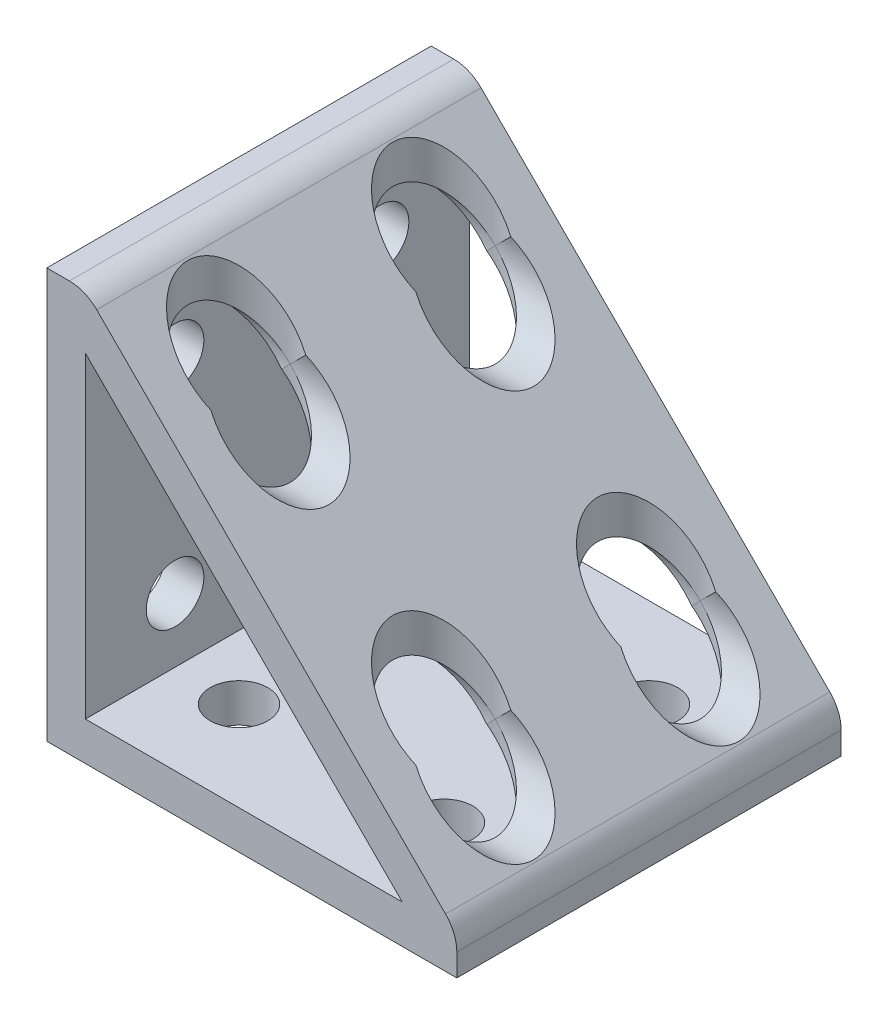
ISO-10303-21;
HEADER;
FILE_DESCRIPTION(('STEP AP214'),'2;1');
FILE_NAME('part.step','',(''),(''),'','','');
FILE_SCHEMA(('AUTOMOTIVE_DESIGN { 1 0 10303 214 1 1 1 1 }'));
ENDSEC;
DATA;
#1=APPLICATION_CONTEXT('core data for automotive mechanical design processes');
#2=APPLICATION_PROTOCOL_DEFINITION('international standard','automotive_design',2000,#1);
#3=PRODUCT_CONTEXT('',#1,'mechanical');
#4=PRODUCT('Part','Part','',(#3));
#5=PRODUCT_RELATED_PRODUCT_CATEGORY('part','',(#4));
#6=PRODUCT_DEFINITION_FORMATION('','',#4);
#7=PRODUCT_DEFINITION_CONTEXT('part definition',#1,'design');
#8=PRODUCT_DEFINITION('design','',#6,#7);
#9=PRODUCT_DEFINITION_SHAPE('','',#8);
#10=(LENGTH_UNIT() NAMED_UNIT(*) SI_UNIT(.MILLI.,.METRE.));
#11=(NAMED_UNIT(*) PLANE_ANGLE_UNIT() SI_UNIT($,.RADIAN.));
#12=(NAMED_UNIT(*) SI_UNIT($,.STERADIAN.) SOLID_ANGLE_UNIT());
#13=UNCERTAINTY_MEASURE_WITH_UNIT(LENGTH_MEASURE(1.E-05),#10,'distance_accuracy_value','');
#14=(GEOMETRIC_REPRESENTATION_CONTEXT(3) GLOBAL_UNCERTAINTY_ASSIGNED_CONTEXT((#13)) GLOBAL_UNIT_ASSIGNED_CONTEXT((#10,
#11,#12)) REPRESENTATION_CONTEXT('',''));
#15=CARTESIAN_POINT('',(0.,0.,0.));
#16=DIRECTION('',(0.,0.,1.));
#17=DIRECTION('',(1.,0.,0.));
#18=AXIS2_PLACEMENT_3D('',#15,#16,#17);
#19=CARTESIAN_POINT('',(25.4,-12.7,12.7));
#20=DIRECTION('',(-1.,0.,0.));
#21=DIRECTION('',(0.,-1.,0.));
#22=AXIS2_PLACEMENT_3D('',#19,#20,#21);
#23=CYLINDRICAL_SURFACE('',#22,6.35);
#24=CARTESIAN_POINT('',(12.7,-12.7,12.7));
#25=DIRECTION('',(-0.707106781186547,-0.707106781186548,0.));
#26=DIRECTION('',(-0.707106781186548,0.707106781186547,0.));
#27=AXIS2_PLACEMENT_3D('',#24,#25,#26);
#28=ELLIPSE('',#27,8.98025612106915,6.35);
#29=CARTESIAN_POINT('',(12.7,-12.7,19.05));
#30=VERTEX_POINT('',#29);
#31=CARTESIAN_POINT('',(12.7,-12.7,6.35));
#32=VERTEX_POINT('',#31);
#33=EDGE_CURVE('E75',#30,#32,#28,.F.);
#34=ORIENTED_EDGE('',*,*,#33,.F.);
#35=CARTESIAN_POINT('',(12.7,-12.7,12.7));
#36=DIRECTION('',(-0.707106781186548,0.707106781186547,0.));
#37=DIRECTION('',(-0.707106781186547,-0.707106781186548,0.));
#38=AXIS2_PLACEMENT_3D('',#35,#36,#37);
#39=ELLIPSE('',#38,8.98025612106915,6.35);
#40=CARTESIAN_POINT('',(15.0876,-10.3124,18.5840348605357));
#41=VERTEX_POINT('',#40);
#42=EDGE_CURVE('E486',#41,#30,#39,.F.);
#43=ORIENTED_EDGE('',*,*,#42,.F.);
#44=CARTESIAN_POINT('',(17.4752,-12.7,12.7));
#45=DIRECTION('',(0.707106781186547,0.707106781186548,0.));
#46=DIRECTION('',(-0.707106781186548,0.707106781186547,0.));
#47=AXIS2_PLACEMENT_3D('',#44,#45,#46);
#48=ELLIPSE('',#47,8.98025612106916,6.35);
#49=CARTESIAN_POINT('',(15.0876,-10.3124,6.81596513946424));
#50=VERTEX_POINT('',#49);
#51=EDGE_CURVE('E394',#50,#41,#48,.F.);
#52=ORIENTED_EDGE('',*,*,#51,.F.);
#53=EDGE_CURVE('E488',#32,#50,#39,.F.);
#54=ORIENTED_EDGE('',*,*,#53,.F.);
#55=EDGE_LOOP('',(#34,#43,#52,#54));
#56=FACE_BOUND('',#55,.T.);
#57=ADVANCED_FACE('F49',(#56),#23,.F.);
#58=CARTESIAN_POINT('',(25.4,12.7,-12.7));
#59=DIRECTION('',(-1.,0.,0.));
#60=DIRECTION('',(0.,-1.,0.));
#61=AXIS2_PLACEMENT_3D('',#58,#59,#60);
#62=CYLINDRICAL_SURFACE('',#61,6.35);
#63=CARTESIAN_POINT('',(-12.7,12.7,-12.7));
#64=DIRECTION('',(-0.707106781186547,-0.707106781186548,0.));
#65=DIRECTION('',(-0.707106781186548,0.707106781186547,0.));
#66=AXIS2_PLACEMENT_3D('',#63,#64,#65);
#67=ELLIPSE('',#66,8.98025612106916,6.35);
#68=CARTESIAN_POINT('',(-12.7,12.7,-6.34999999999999));
#69=VERTEX_POINT('',#68);
#70=CARTESIAN_POINT('',(-12.7,12.7,-19.05));
#71=VERTEX_POINT('',#70);
#72=EDGE_CURVE('E67',#69,#71,#67,.F.);
#73=ORIENTED_EDGE('',*,*,#72,.F.);
#74=CARTESIAN_POINT('',(-12.7,12.7,-12.7));
#75=DIRECTION('',(-0.707106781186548,0.707106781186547,0.));
#76=DIRECTION('',(-0.707106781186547,-0.707106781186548,0.));
#77=AXIS2_PLACEMENT_3D('',#74,#75,#76);
#78=ELLIPSE('',#77,8.98025612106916,6.35);
#79=CARTESIAN_POINT('',(-10.3124,15.0876,-6.81596513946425));
#80=VERTEX_POINT('',#79);
#81=EDGE_CURVE('E502',#80,#69,#78,.F.);
#82=ORIENTED_EDGE('',*,*,#81,.F.);
#83=CARTESIAN_POINT('',(-7.92479999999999,12.7,-12.7));
#84=DIRECTION('',(0.707106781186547,0.707106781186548,0.));
#85=DIRECTION('',(-0.707106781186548,0.707106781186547,0.));
#86=AXIS2_PLACEMENT_3D('',#83,#84,#85);
#87=ELLIPSE('',#86,8.98025612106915,6.35);
#88=CARTESIAN_POINT('',(-10.3124,15.0876,-18.5840348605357));
#89=VERTEX_POINT('',#88);
#90=EDGE_CURVE('E388',#89,#80,#87,.F.);
#91=ORIENTED_EDGE('',*,*,#90,.F.);
#92=EDGE_CURVE('E504',#71,#89,#78,.F.);
#93=ORIENTED_EDGE('',*,*,#92,.F.);
#94=EDGE_LOOP('',(#73,#82,#91,#93));
#95=FACE_BOUND('',#94,.T.);
#96=ADVANCED_FACE('F455',(#95),#62,.F.);
#97=CARTESIAN_POINT('',(25.4,12.7,12.7));
#98=DIRECTION('',(-1.,0.,0.));
#99=DIRECTION('',(0.,-1.,0.));
#100=AXIS2_PLACEMENT_3D('',#97,#98,#99);
#101=CYLINDRICAL_SURFACE('',#100,6.35);
#102=CARTESIAN_POINT('',(-12.7,12.7,12.7));
#103=DIRECTION('',(-0.707106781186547,-0.707106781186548,0.));
#104=DIRECTION('',(-0.707106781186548,0.707106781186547,0.));
#105=AXIS2_PLACEMENT_3D('',#102,#103,#104);
#106=ELLIPSE('',#105,8.98025612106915,6.35);
#107=CARTESIAN_POINT('',(-12.7,12.7,19.05));
#108=VERTEX_POINT('',#107);
#109=CARTESIAN_POINT('',(-12.7,12.7,6.35));
#110=VERTEX_POINT('',#109);
#111=EDGE_CURVE('E563',#108,#110,#106,.F.);
#112=ORIENTED_EDGE('',*,*,#111,.F.);
#113=CARTESIAN_POINT('',(-12.7,12.7,12.7));
#114=DIRECTION('',(-0.707106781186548,0.707106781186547,0.));
#115=DIRECTION('',(-0.707106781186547,-0.707106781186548,0.));
#116=AXIS2_PLACEMENT_3D('',#113,#114,#115);
#117=ELLIPSE('',#116,8.98025612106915,6.35);
#118=CARTESIAN_POINT('',(-10.3124,15.0876,18.5840348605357));
#119=VERTEX_POINT('',#118);
#120=EDGE_CURVE('E561',#119,#108,#117,.F.);
#121=ORIENTED_EDGE('',*,*,#120,.F.);
#122=CARTESIAN_POINT('',(-7.92479999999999,12.7,12.7));
#123=DIRECTION('',(0.707106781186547,0.707106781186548,0.));
#124=DIRECTION('',(-0.707106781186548,0.707106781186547,0.));
#125=AXIS2_PLACEMENT_3D('',#122,#123,#124);
#126=ELLIPSE('',#125,8.98025612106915,6.35);
#127=CARTESIAN_POINT('',(-10.3124,15.0876,6.81596513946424));
#128=VERTEX_POINT('',#127);
#129=EDGE_CURVE('E401',#128,#119,#126,.F.);
#130=ORIENTED_EDGE('',*,*,#129,.F.);
#131=EDGE_CURVE('E560',#110,#128,#117,.F.);
#132=ORIENTED_EDGE('',*,*,#131,.F.);
#133=EDGE_LOOP('',(#112,#121,#130,#132));
#134=FACE_BOUND('',#133,.T.);
#135=ADVANCED_FACE('F461',(#134),#101,.F.);
#136=CARTESIAN_POINT('',(25.4,-12.7,-12.7));
#137=DIRECTION('',(-1.,0.,0.));
#138=DIRECTION('',(0.,-1.,0.));
#139=AXIS2_PLACEMENT_3D('',#136,#137,#138);
#140=CYLINDRICAL_SURFACE('',#139,6.35);
#141=CARTESIAN_POINT('',(12.7,-12.7,-12.7));
#142=DIRECTION('',(-0.707106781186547,-0.707106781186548,0.));
#143=DIRECTION('',(-0.707106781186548,0.707106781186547,0.));
#144=AXIS2_PLACEMENT_3D('',#141,#142,#143);
#145=ELLIPSE('',#144,8.98025612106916,6.35);
#146=CARTESIAN_POINT('',(12.7,-12.7,-6.34999999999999));
#147=VERTEX_POINT('',#146);
#148=CARTESIAN_POINT('',(12.7,-12.7,-19.05));
#149=VERTEX_POINT('',#148);
#150=EDGE_CURVE('E546',#147,#149,#145,.F.);
#151=ORIENTED_EDGE('',*,*,#150,.F.);
#152=CARTESIAN_POINT('',(12.7,-12.7,-12.7));
#153=DIRECTION('',(-0.707106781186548,0.707106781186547,0.));
#154=DIRECTION('',(-0.707106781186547,-0.707106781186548,0.));
#155=AXIS2_PLACEMENT_3D('',#152,#153,#154);
#156=ELLIPSE('',#155,8.98025612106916,6.35);
#157=CARTESIAN_POINT('',(15.0876,-10.3124,-6.81596513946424));
#158=VERTEX_POINT('',#157);
#159=EDGE_CURVE('E544',#158,#147,#156,.F.);
#160=ORIENTED_EDGE('',*,*,#159,.F.);
#161=CARTESIAN_POINT('',(17.4752,-12.7,-12.7));
#162=DIRECTION('',(0.707106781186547,0.707106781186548,0.));
#163=DIRECTION('',(-0.707106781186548,0.707106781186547,0.));
#164=AXIS2_PLACEMENT_3D('',#161,#162,#163);
#165=ELLIPSE('',#164,8.98025612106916,6.35);
#166=CARTESIAN_POINT('',(15.0876,-10.3124,-18.5840348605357));
#167=VERTEX_POINT('',#166);
#168=EDGE_CURVE('E407',#167,#158,#165,.F.);
#169=ORIENTED_EDGE('',*,*,#168,.F.);
#170=EDGE_CURVE('E543',#149,#167,#156,.F.);
#171=ORIENTED_EDGE('',*,*,#170,.F.);
#172=EDGE_LOOP('',(#151,#160,#169,#171));
#173=FACE_BOUND('',#172,.T.);
#174=ADVANCED_FACE('F467',(#173),#140,.F.);
#175=CARTESIAN_POINT('',(12.7,-12.7,12.7));
#176=DIRECTION('',(-0.707106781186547,-0.707106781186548,0.));
#177=DIRECTION('',(-0.707106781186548,0.707106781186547,0.));
#178=AXIS2_PLACEMENT_3D('',#175,#176,#177);
#179=ELLIPSE('',#178,8.98025612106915,6.35);
#180=EDGE_CURVE('E479',#30,#32,#179,.T.);
#181=ORIENTED_EDGE('',*,*,#180,.F.);
#182=CARTESIAN_POINT('',(12.7,-12.7,12.7));
#183=DIRECTION('',(-0.707106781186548,0.707106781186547,0.));
#184=DIRECTION('',(-0.707106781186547,-0.707106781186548,0.));
#185=AXIS2_PLACEMENT_3D('',#182,#183,#184);
#186=ELLIPSE('',#185,8.98025612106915,6.35);
#187=CARTESIAN_POINT('',(11.711023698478,-13.688976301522,18.9725135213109));
#188=VERTEX_POINT('',#187);
#189=EDGE_CURVE('E247',#188,#30,#186,.T.);
#190=ORIENTED_EDGE('',*,*,#189,.F.);
#191=CARTESIAN_POINT('',(10.722047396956,-12.7,12.7));
#192=DIRECTION('',(0.707106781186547,0.707106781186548,0.));
#193=DIRECTION('',(-0.707106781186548,0.707106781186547,0.));
#194=AXIS2_PLACEMENT_3D('',#191,#192,#193);
#195=ELLIPSE('',#194,8.98025612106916,6.35);
#196=CARTESIAN_POINT('',(11.711023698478,-13.688976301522,6.42748647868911));
#197=VERTEX_POINT('',#196);
#198=EDGE_CURVE('E246',#188,#197,#195,.F.);
#199=ORIENTED_EDGE('',*,*,#198,.T.);
#200=EDGE_CURVE('E480',#32,#197,#186,.T.);
#201=ORIENTED_EDGE('',*,*,#200,.F.);
#202=EDGE_LOOP('',(#181,#190,#199,#201));
#203=FACE_BOUND('',#202,.T.);
#204=ADVANCED_FACE('F457',(#203),#23,.F.);
#205=CARTESIAN_POINT('',(-12.7,12.7,-12.7));
#206=DIRECTION('',(-0.707106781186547,-0.707106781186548,0.));
#207=DIRECTION('',(-0.707106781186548,0.707106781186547,0.));
#208=AXIS2_PLACEMENT_3D('',#205,#206,#207);
#209=ELLIPSE('',#208,8.98025612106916,6.35);
#210=EDGE_CURVE('E499',#69,#71,#209,.T.);
#211=ORIENTED_EDGE('',*,*,#210,.F.);
#212=CARTESIAN_POINT('',(-12.7,12.7,-12.7));
#213=DIRECTION('',(-0.707106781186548,0.707106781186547,0.));
#214=DIRECTION('',(-0.707106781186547,-0.707106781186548,0.));
#215=AXIS2_PLACEMENT_3D('',#212,#213,#214);
#216=ELLIPSE('',#215,8.98025612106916,6.35);
#217=CARTESIAN_POINT('',(-13.6889763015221,11.7110236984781,-6.42748647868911));
#218=VERTEX_POINT('',#217);
#219=EDGE_CURVE('E496',#218,#69,#216,.T.);
#220=ORIENTED_EDGE('',*,*,#219,.F.);
#221=CARTESIAN_POINT('',(-14.677952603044,12.7,-12.7));
#222=DIRECTION('',(0.707106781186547,0.707106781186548,0.));
#223=DIRECTION('',(-0.707106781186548,0.707106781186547,0.));
#224=AXIS2_PLACEMENT_3D('',#221,#222,#223);
#225=ELLIPSE('',#224,8.98025612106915,6.35);
#226=CARTESIAN_POINT('',(-20.6248,18.646847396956,-10.4734542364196));
#227=VERTEX_POINT('',#226);
#228=EDGE_CURVE('E389',#218,#227,#225,.F.);
#229=ORIENTED_EDGE('',*,*,#228,.T.);
#230=CARTESIAN_POINT('',(-20.6248,12.7,-12.7));
#231=DIRECTION('',(1.,0.,0.));
#232=DIRECTION('',(0.,1.,0.));
#233=AXIS2_PLACEMENT_3D('',#230,#231,#232);
#234=CIRCLE('',#233,6.35);
#235=CARTESIAN_POINT('',(-20.6248,18.646847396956,-14.9265457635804));
#236=VERTEX_POINT('',#235);
#237=EDGE_CURVE('E378',#236,#227,#234,.T.);
#238=ORIENTED_EDGE('',*,*,#237,.F.);
#239=CARTESIAN_POINT('',(-13.688976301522,11.711023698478,-18.9725135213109));
#240=VERTEX_POINT('',#239);
#241=EDGE_CURVE('E384',#236,#240,#225,.F.);
#242=ORIENTED_EDGE('',*,*,#241,.T.);
#243=EDGE_CURVE('E498',#71,#240,#216,.T.);
#244=ORIENTED_EDGE('',*,*,#243,.F.);
#245=EDGE_LOOP('',(#211,#220,#229,#238,#242,#244));
#246=FACE_BOUND('',#245,.T.);
#247=ADVANCED_FACE('F464',(#246),#62,.F.);
#248=CARTESIAN_POINT('',(-12.7,12.7,12.7));
#249=DIRECTION('',(-0.707106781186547,-0.707106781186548,0.));
#250=DIRECTION('',(-0.707106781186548,0.707106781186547,0.));
#251=AXIS2_PLACEMENT_3D('',#248,#249,#250);
#252=ELLIPSE('',#251,8.98025612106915,6.35);
#253=EDGE_CURVE('E565',#108,#110,#252,.T.);
#254=ORIENTED_EDGE('',*,*,#253,.F.);
#255=CARTESIAN_POINT('',(-12.7,12.7,12.7));
#256=DIRECTION('',(-0.707106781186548,0.707106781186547,0.));
#257=DIRECTION('',(-0.707106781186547,-0.707106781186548,0.));
#258=AXIS2_PLACEMENT_3D('',#255,#256,#257);
#259=ELLIPSE('',#258,8.98025612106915,6.35);
#260=CARTESIAN_POINT('',(-13.688976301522,11.711023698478,18.9725135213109));
#261=VERTEX_POINT('',#260);
#262=EDGE_CURVE('E569',#261,#108,#259,.T.);
#263=ORIENTED_EDGE('',*,*,#262,.F.);
#264=CARTESIAN_POINT('',(-14.677952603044,12.7,12.7));
#265=DIRECTION('',(0.707106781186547,0.707106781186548,0.));
#266=DIRECTION('',(-0.707106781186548,0.707106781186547,0.));
#267=AXIS2_PLACEMENT_3D('',#264,#265,#266);
#268=ELLIPSE('',#267,8.98025612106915,6.35);
#269=CARTESIAN_POINT('',(-20.6248,18.646847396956,14.9265457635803));
#270=VERTEX_POINT('',#269);
#271=EDGE_CURVE('E392',#261,#270,#268,.F.);
#272=ORIENTED_EDGE('',*,*,#271,.T.);
#273=CARTESIAN_POINT('',(-20.6248,12.7,12.7));
#274=DIRECTION('',(1.,0.,0.));
#275=DIRECTION('',(0.,1.,0.));
#276=AXIS2_PLACEMENT_3D('',#273,#274,#275);
#277=CIRCLE('',#276,6.35);
#278=CARTESIAN_POINT('',(-20.6248,18.646847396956,10.4734542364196));
#279=VERTEX_POINT('',#278);
#280=EDGE_CURVE('E534',#279,#270,#277,.T.);
#281=ORIENTED_EDGE('',*,*,#280,.F.);
#282=CARTESIAN_POINT('',(-13.688976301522,11.711023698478,6.42748647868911));
#283=VERTEX_POINT('',#282);
#284=EDGE_CURVE('E398',#279,#283,#268,.F.);
#285=ORIENTED_EDGE('',*,*,#284,.T.);
#286=EDGE_CURVE('E568',#110,#283,#259,.T.);
#287=ORIENTED_EDGE('',*,*,#286,.F.);
#288=EDGE_LOOP('',(#254,#263,#272,#281,#285,#287));
#289=FACE_BOUND('',#288,.T.);
#290=ADVANCED_FACE('F473',(#289),#101,.F.);
#291=CARTESIAN_POINT('',(12.7,-12.7,-12.7));
#292=DIRECTION('',(-0.707106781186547,-0.707106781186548,0.));
#293=DIRECTION('',(-0.707106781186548,0.707106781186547,0.));
#294=AXIS2_PLACEMENT_3D('',#291,#292,#293);
#295=ELLIPSE('',#294,8.98025612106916,6.35);
#296=EDGE_CURVE('E548',#147,#149,#295,.T.);
#297=ORIENTED_EDGE('',*,*,#296,.F.);
#298=CARTESIAN_POINT('',(12.7,-12.7,-12.7));
#299=DIRECTION('',(-0.707106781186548,0.707106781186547,0.));
#300=DIRECTION('',(-0.707106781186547,-0.707106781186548,0.));
#301=AXIS2_PLACEMENT_3D('',#298,#299,#300);
#302=ELLIPSE('',#301,8.98025612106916,6.35);
#303=CARTESIAN_POINT('',(11.711023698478,-13.688976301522,-6.42748647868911));
#304=VERTEX_POINT('',#303);
#305=EDGE_CURVE('E551',#304,#147,#302,.T.);
#306=ORIENTED_EDGE('',*,*,#305,.F.);
#307=CARTESIAN_POINT('',(10.722047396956,-12.7,-12.7));
#308=DIRECTION('',(0.707106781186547,0.707106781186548,0.));
#309=DIRECTION('',(-0.707106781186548,0.707106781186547,0.));
#310=AXIS2_PLACEMENT_3D('',#307,#308,#309);
#311=ELLIPSE('',#310,8.98025612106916,6.35);
#312=CARTESIAN_POINT('',(11.711023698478,-13.688976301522,-18.9725135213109));
#313=VERTEX_POINT('',#312);
#314=EDGE_CURVE('E404',#304,#313,#311,.F.);
#315=ORIENTED_EDGE('',*,*,#314,.T.);
#316=EDGE_CURVE('E555',#149,#313,#302,.T.);
#317=ORIENTED_EDGE('',*,*,#316,.F.);
#318=EDGE_LOOP('',(#297,#306,#315,#317));
#319=FACE_BOUND('',#318,.T.);
#320=ADVANCED_FACE('F476',(#319),#140,.F.);
#321=CARTESIAN_POINT('',(-22.602752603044,25.4,-23.8125));
#322=DIRECTION('',(0.,1.,0.));
#323=DIRECTION('',(0.,0.,1.));
#324=AXIS2_PLACEMENT_3D('',#321,#322,#323);
#325=PLANE('',#324);
#326=DIRECTION('',(0.,0.,1.));
#327=VECTOR('',#326,1.);
#328=CARTESIAN_POINT('',(-25.4,25.4,-23.8125));
#329=LINE('',#328,#327);
#330=CARTESIAN_POINT('',(-25.4,25.4,-23.8125));
#331=VERTEX_POINT('',#330);
#332=CARTESIAN_POINT('',(-25.4,25.4,23.8125));
#333=VERTEX_POINT('',#332);
#334=EDGE_CURVE('E289',#331,#333,#329,.T.);
#335=ORIENTED_EDGE('',*,*,#334,.T.);
#336=DIRECTION('',(-1.,0.,0.));
#337=VECTOR('',#336,1.);
#338=CARTESIAN_POINT('',(-22.602752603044,25.4,23.8125));
#339=LINE('',#338,#337);
#340=CARTESIAN_POINT('',(-22.602752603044,25.4,23.8125));
#341=VERTEX_POINT('',#340);
#342=EDGE_CURVE('E338',#341,#333,#339,.T.);
#343=ORIENTED_EDGE('',*,*,#342,.F.);
#344=DIRECTION('',(0.,0.,1.));
#345=VECTOR('',#344,1.);
#346=CARTESIAN_POINT('',(-22.602752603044,25.4,-23.8125));
#347=LINE('',#346,#345);
#348=CARTESIAN_POINT('',(-22.602752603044,25.4,-23.8125));
#349=VERTEX_POINT('',#348);
#350=EDGE_CURVE('E12',#349,#341,#347,.T.);
#351=ORIENTED_EDGE('',*,*,#350,.F.);
#352=DIRECTION('',(-1.,0.,0.));
#353=VECTOR('',#352,1.);
#354=CARTESIAN_POINT('',(-22.602752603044,25.4,-23.8125));
#355=LINE('',#354,#353);
#356=EDGE_CURVE('E263',#349,#331,#355,.T.);
#357=ORIENTED_EDGE('',*,*,#356,.T.);
#358=EDGE_LOOP('',(#335,#343,#351,#357));
#359=FACE_BOUND('',#358,.T.);
#360=ADVANCED_FACE('F51',(#359),#325,.T.);
#361=CARTESIAN_POINT('',(-22.602752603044,20.6248,-23.8125));
#362=DIRECTION('',(0.,0.,1.));
#363=DIRECTION('',(1.,0.,0.));
#364=AXIS2_PLACEMENT_3D('',#361,#362,#363);
#365=CYLINDRICAL_SURFACE('',#364,4.7752);
#366=ORIENTED_EDGE('',*,*,#350,.T.);
#367=CARTESIAN_POINT('',(-22.602752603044,20.6248,23.8125));
#368=DIRECTION('',(0.,0.,1.));
#369=DIRECTION('',(1.,0.,0.));
#370=AXIS2_PLACEMENT_3D('',#367,#368,#369);
#371=CIRCLE('',#370,4.7752);
#372=CARTESIAN_POINT('',(-19.226176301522,24.001376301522,23.8125));
#373=VERTEX_POINT('',#372);
#374=EDGE_CURVE('E356',#373,#341,#371,.T.);
#375=ORIENTED_EDGE('',*,*,#374,.F.);
#376=DIRECTION('',(0.,0.,1.));
#377=VECTOR('',#376,1.);
#378=CARTESIAN_POINT('',(-19.226176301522,24.001376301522,-23.8125));
#379=LINE('',#378,#377);
#380=CARTESIAN_POINT('',(-19.226176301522,24.001376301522,-23.8125));
#381=VERTEX_POINT('',#380);
#382=EDGE_CURVE('E59',#381,#373,#379,.T.);
#383=ORIENTED_EDGE('',*,*,#382,.F.);
#384=CARTESIAN_POINT('',(-22.602752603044,20.6248,-23.8125));
#385=DIRECTION('',(0.,0.,1.));
#386=DIRECTION('',(1.,0.,0.));
#387=AXIS2_PLACEMENT_3D('',#384,#385,#386);
#388=CIRCLE('',#387,4.7752);
#389=EDGE_CURVE('E287',#381,#349,#388,.T.);
#390=ORIENTED_EDGE('',*,*,#389,.T.);
#391=EDGE_LOOP('',(#366,#375,#383,#390));
#392=FACE_BOUND('',#391,.T.);
#393=ADVANCED_FACE('F592',(#392),#365,.T.);
#394=CARTESIAN_POINT('',(24.001376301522,-19.226176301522,-23.8125));
#395=DIRECTION('',(0.707106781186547,0.707106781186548,0.));
#396=DIRECTION('',(-0.707106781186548,0.707106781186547,0.));
#397=AXIS2_PLACEMENT_3D('',#394,#395,#396);
#398=PLANE('',#397);
#399=CARTESIAN_POINT('',(-12.7,17.4752,-12.7));
#400=DIRECTION('',(0.707106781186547,0.707106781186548,0.));
#401=DIRECTION('',(0.707106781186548,-0.707106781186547,0.));
#402=AXIS2_PLACEMENT_3D('',#399,#400,#401);
#403=ELLIPSE('',#402,8.98025612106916,6.35);
#404=EDGE_CURVE('E505',#89,#80,#403,.T.);
#405=ORIENTED_EDGE('',*,*,#404,.F.);
#406=ORIENTED_EDGE('',*,*,#90,.T.);
#407=EDGE_LOOP('',(#405,#406));
#408=FACE_BOUND('',#407,.T.);
#409=CARTESIAN_POINT('',(12.7,-7.92479999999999,12.7));
#410=DIRECTION('',(0.707106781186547,0.707106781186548,0.));
#411=DIRECTION('',(0.707106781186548,-0.707106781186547,0.));
#412=AXIS2_PLACEMENT_3D('',#409,#410,#411);
#413=ELLIPSE('',#412,8.98025612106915,6.35);
#414=EDGE_CURVE('E490',#50,#41,#413,.T.);
#415=ORIENTED_EDGE('',*,*,#414,.F.);
#416=ORIENTED_EDGE('',*,*,#51,.T.);
#417=EDGE_LOOP('',(#415,#416));
#418=FACE_BOUND('',#417,.T.);
#419=CARTESIAN_POINT('',(12.7,-7.92479999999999,-12.7));
#420=DIRECTION('',(0.707106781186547,0.707106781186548,0.));
#421=DIRECTION('',(0.707106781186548,-0.707106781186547,0.));
#422=AXIS2_PLACEMENT_3D('',#419,#420,#421);
#423=ELLIPSE('',#422,8.98025612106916,6.35);
#424=EDGE_CURVE('E541',#167,#158,#423,.T.);
#425=ORIENTED_EDGE('',*,*,#424,.F.);
#426=ORIENTED_EDGE('',*,*,#168,.T.);
#427=EDGE_LOOP('',(#425,#426));
#428=FACE_BOUND('',#427,.T.);
#429=CARTESIAN_POINT('',(-12.7,17.4752,12.7));
#430=DIRECTION('',(0.707106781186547,0.707106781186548,0.));
#431=DIRECTION('',(0.707106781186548,-0.707106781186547,0.));
#432=AXIS2_PLACEMENT_3D('',#429,#430,#431);
#433=ELLIPSE('',#432,8.98025612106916,6.35);
#434=EDGE_CURVE('E558',#128,#119,#433,.T.);
#435=ORIENTED_EDGE('',*,*,#434,.F.);
#436=ORIENTED_EDGE('',*,*,#129,.T.);
#437=EDGE_LOOP('',(#435,#436));
#438=FACE_BOUND('',#437,.T.);
#439=ORIENTED_EDGE('',*,*,#382,.T.);
#440=DIRECTION('',(-0.707106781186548,0.707106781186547,0.));
#441=VECTOR('',#440,1.);
#442=CARTESIAN_POINT('',(24.001376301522,-19.226176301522,23.8125));
#443=LINE('',#442,#441);
#444=CARTESIAN_POINT('',(24.001376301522,-19.226176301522,23.8125));
#445=VERTEX_POINT('',#444);
#446=EDGE_CURVE('E353',#445,#373,#443,.T.);
#447=ORIENTED_EDGE('',*,*,#446,.F.);
#448=DIRECTION('',(0.,0.,1.));
#449=VECTOR('',#448,1.);
#450=CARTESIAN_POINT('',(24.001376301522,-19.226176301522,-23.8125));
#451=LINE('',#450,#449);
#452=CARTESIAN_POINT('',(24.001376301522,-19.226176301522,-23.8125));
#453=VERTEX_POINT('',#452);
#454=EDGE_CURVE('E292',#453,#445,#451,.T.);
#455=ORIENTED_EDGE('',*,*,#454,.F.);
#456=DIRECTION('',(-0.707106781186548,0.707106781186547,0.));
#457=VECTOR('',#456,1.);
#458=CARTESIAN_POINT('',(24.001376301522,-19.226176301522,-23.8125));
#459=LINE('',#458,#457);
#460=EDGE_CURVE('E284',#453,#381,#459,.T.);
#461=ORIENTED_EDGE('',*,*,#460,.T.);
#462=EDGE_LOOP('',(#439,#447,#455,#461));
#463=FACE_BOUND('',#462,.T.);
#464=ADVANCED_FACE('F537',(#408,#418,#428,#438,#463),#398,.T.);
#465=CARTESIAN_POINT('',(20.6248,-22.602752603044,-23.8125));
#466=DIRECTION('',(0.,0.,1.));
#467=DIRECTION('',(1.,0.,0.));
#468=AXIS2_PLACEMENT_3D('',#465,#466,#467);
#469=CYLINDRICAL_SURFACE('',#468,4.7752);
#470=ORIENTED_EDGE('',*,*,#454,.T.);
#471=CARTESIAN_POINT('',(20.6248,-22.602752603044,23.8125));
#472=DIRECTION('',(0.,0.,1.));
#473=DIRECTION('',(1.,0.,0.));
#474=AXIS2_PLACEMENT_3D('',#471,#472,#473);
#475=CIRCLE('',#474,4.7752);
#476=CARTESIAN_POINT('',(25.4,-22.602752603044,23.8125));
#477=VERTEX_POINT('',#476);
#478=EDGE_CURVE('E350',#477,#445,#475,.T.);
#479=ORIENTED_EDGE('',*,*,#478,.F.);
#480=DIRECTION('',(0.,0.,1.));
#481=VECTOR('',#480,1.);
#482=CARTESIAN_POINT('',(25.4,-22.602752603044,-23.8125));
#483=LINE('',#482,#481);
#484=CARTESIAN_POINT('',(25.4,-22.602752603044,-23.8125));
#485=VERTEX_POINT('',#484);
#486=EDGE_CURVE('E294',#485,#477,#483,.T.);
#487=ORIENTED_EDGE('',*,*,#486,.F.);
#488=CARTESIAN_POINT('',(20.6248,-22.602752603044,-23.8125));
#489=DIRECTION('',(0.,0.,1.));
#490=DIRECTION('',(1.,0.,0.));
#491=AXIS2_PLACEMENT_3D('',#488,#489,#490);
#492=CIRCLE('',#491,4.7752);
#493=EDGE_CURVE('E281',#485,#453,#492,.T.);
#494=ORIENTED_EDGE('',*,*,#493,.T.);
#495=EDGE_LOOP('',(#470,#479,#487,#494));
#496=FACE_BOUND('',#495,.T.);
#497=ADVANCED_FACE('F591',(#496),#469,.T.);
#498=CARTESIAN_POINT('',(25.4,-25.4,-23.8125));
#499=DIRECTION('',(1.,0.,0.));
#500=DIRECTION('',(0.,0.,-1.));
#501=AXIS2_PLACEMENT_3D('',#498,#499,#500);
#502=PLANE('',#501);
#503=ORIENTED_EDGE('',*,*,#486,.T.);
#504=DIRECTION('',(0.,1.,0.));
#505=VECTOR('',#504,1.);
#506=CARTESIAN_POINT('',(25.4,-25.4,23.8125));
#507=LINE('',#506,#505);
#508=CARTESIAN_POINT('',(25.4,-25.4,23.8125));
#509=VERTEX_POINT('',#508);
#510=EDGE_CURVE('E347',#509,#477,#507,.T.);
#511=ORIENTED_EDGE('',*,*,#510,.F.);
#512=DIRECTION('',(0.,0.,1.));
#513=VECTOR('',#512,1.);
#514=CARTESIAN_POINT('',(25.4,-25.4,-23.8125));
#515=LINE('',#514,#513);
#516=CARTESIAN_POINT('',(25.4,-25.4,-23.8125));
#517=VERTEX_POINT('',#516);
#518=EDGE_CURVE('E296',#517,#509,#515,.T.);
#519=ORIENTED_EDGE('',*,*,#518,.F.);
#520=DIRECTION('',(0.,1.,0.));
#521=VECTOR('',#520,1.);
#522=CARTESIAN_POINT('',(25.4,-25.4,-23.8125));
#523=LINE('',#522,#521);
#524=EDGE_CURVE('E278',#517,#485,#523,.T.);
#525=ORIENTED_EDGE('',*,*,#524,.T.);
#526=EDGE_LOOP('',(#503,#511,#519,#525));
#527=FACE_BOUND('',#526,.T.);
#528=ADVANCED_FACE('F620',(#527),#502,.T.);
#529=CARTESIAN_POINT('',(-25.4,-25.4,-23.8125));
#530=DIRECTION('',(0.,-1.,0.));
#531=DIRECTION('',(0.,0.,-1.));
#532=AXIS2_PLACEMENT_3D('',#529,#530,#531);
#533=PLANE('',#532);
#534=CARTESIAN_POINT('',(12.7,-25.4,12.7));
#535=DIRECTION('',(0.,1.,0.));
#536=DIRECTION('',(-1.,0.,0.));
#537=AXIS2_PLACEMENT_3D('',#534,#535,#536);
#538=CIRCLE('',#537,3.56870000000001);
#539=CARTESIAN_POINT('',(9.13129999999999,-25.4,12.7));
#540=VERTEX_POINT('',#539);
#541=EDGE_CURVE('E507',#540,#540,#538,.T.);
#542=ORIENTED_EDGE('',*,*,#541,.T.);
#543=EDGE_LOOP('',(#542));
#544=FACE_BOUND('',#543,.T.);
#545=CARTESIAN_POINT('',(12.7,-25.4,-12.7));
#546=DIRECTION('',(0.,1.,0.));
#547=DIRECTION('',(-1.,0.,0.));
#548=AXIS2_PLACEMENT_3D('',#545,#546,#547);
#549=CIRCLE('',#548,3.56870000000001);
#550=CARTESIAN_POINT('',(9.13129999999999,-25.4,-12.7));
#551=VERTEX_POINT('',#550);
#552=EDGE_CURVE('E512',#551,#551,#549,.T.);
#553=ORIENTED_EDGE('',*,*,#552,.T.);
#554=EDGE_LOOP('',(#553));
#555=FACE_BOUND('',#554,.T.);
#556=CARTESIAN_POINT('',(-12.7,-25.4,-12.7));
#557=DIRECTION('',(0.,1.,0.));
#558=DIRECTION('',(1.,0.,0.));
#559=AXIS2_PLACEMENT_3D('',#556,#557,#558);
#560=CIRCLE('',#559,3.5687);
#561=CARTESIAN_POINT('',(-9.1313,-25.4,-12.7));
#562=VERTEX_POINT('',#561);
#563=EDGE_CURVE('E508',#562,#562,#560,.T.);
#564=ORIENTED_EDGE('',*,*,#563,.T.);
#565=EDGE_LOOP('',(#564));
#566=FACE_BOUND('',#565,.T.);
#567=CARTESIAN_POINT('',(-12.7,-25.4,12.7));
#568=DIRECTION('',(0.,1.,0.));
#569=DIRECTION('',(-1.,0.,0.));
#570=AXIS2_PLACEMENT_3D('',#567,#568,#569);
#571=CIRCLE('',#570,3.5687);
#572=CARTESIAN_POINT('',(-16.2687,-25.4,12.7));
#573=VERTEX_POINT('',#572);
#574=EDGE_CURVE('E511',#573,#573,#571,.T.);
#575=ORIENTED_EDGE('',*,*,#574,.T.);
#576=EDGE_LOOP('',(#575));
#577=FACE_BOUND('',#576,.T.);
#578=ORIENTED_EDGE('',*,*,#518,.T.);
#579=DIRECTION('',(1.,0.,0.));
#580=VECTOR('',#579,1.);
#581=CARTESIAN_POINT('',(-25.4,-25.4,23.8125));
#582=LINE('',#581,#580);
#583=CARTESIAN_POINT('',(-25.4,-25.4,23.8125));
#584=VERTEX_POINT('',#583);
#585=EDGE_CURVE('E344',#584,#509,#582,.T.);
#586=ORIENTED_EDGE('',*,*,#585,.F.);
#587=DIRECTION('',(0.,0.,1.));
#588=VECTOR('',#587,1.);
#589=CARTESIAN_POINT('',(-25.4,-25.4,-23.8125));
#590=LINE('',#589,#588);
#591=CARTESIAN_POINT('',(-25.4,-25.4,-23.8125));
#592=VERTEX_POINT('',#591);
#593=EDGE_CURVE('E298',#592,#584,#590,.T.);
#594=ORIENTED_EDGE('',*,*,#593,.F.);
#595=DIRECTION('',(1.,0.,0.));
#596=VECTOR('',#595,1.);
#597=CARTESIAN_POINT('',(-25.4,-25.4,-23.8125));
#598=LINE('',#597,#596);
#599=EDGE_CURVE('E272',#592,#517,#598,.T.);
#600=ORIENTED_EDGE('',*,*,#599,.T.);
#601=EDGE_LOOP('',(#578,#586,#594,#600));
#602=FACE_BOUND('',#601,.T.);
#603=ADVANCED_FACE('F618',(#544,#555,#566,#577,#602),#533,.T.);
#604=CARTESIAN_POINT('',(-25.4,25.4,-23.8125));
#605=DIRECTION('',(-1.,0.,0.));
#606=DIRECTION('',(0.,-1.,0.));
#607=AXIS2_PLACEMENT_3D('',#604,#605,#606);
#608=PLANE('',#607);
#609=CARTESIAN_POINT('',(-25.4,12.7,12.7));
#610=DIRECTION('',(-1.,0.,0.));
#611=DIRECTION('',(0.,-1.,0.));
#612=AXIS2_PLACEMENT_3D('',#609,#610,#611);
#613=CIRCLE('',#612,3.56870000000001);
#614=CARTESIAN_POINT('',(-25.4,9.13129999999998,12.7));
#615=VERTEX_POINT('',#614);
#616=EDGE_CURVE('E326',#615,#615,#613,.T.);
#617=ORIENTED_EDGE('',*,*,#616,.F.);
#618=EDGE_LOOP('',(#617));
#619=FACE_BOUND('',#618,.T.);
#620=CARTESIAN_POINT('',(-25.4,12.7,-12.7));
#621=DIRECTION('',(-1.,0.,0.));
#622=DIRECTION('',(0.,-1.,0.));
#623=AXIS2_PLACEMENT_3D('',#620,#621,#622);
#624=CIRCLE('',#623,3.56870000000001);
#625=CARTESIAN_POINT('',(-25.4,9.13129999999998,-12.7));
#626=VERTEX_POINT('',#625);
#627=EDGE_CURVE('E412',#626,#626,#624,.T.);
#628=ORIENTED_EDGE('',*,*,#627,.F.);
#629=EDGE_LOOP('',(#628));
#630=FACE_BOUND('',#629,.T.);
#631=CARTESIAN_POINT('',(-25.4,-12.7,-12.7));
#632=DIRECTION('',(-1.,0.,0.));
#633=DIRECTION('',(0.,1.,0.));
#634=AXIS2_PLACEMENT_3D('',#631,#632,#633);
#635=CIRCLE('',#634,3.5687);
#636=CARTESIAN_POINT('',(-25.4,-16.2687,-12.7));
#637=VERTEX_POINT('',#636);
#638=EDGE_CURVE('E325',#637,#637,#635,.T.);
#639=ORIENTED_EDGE('',*,*,#638,.F.);
#640=EDGE_LOOP('',(#639));
#641=FACE_BOUND('',#640,.T.);
#642=CARTESIAN_POINT('',(-25.4,-12.7,12.7));
#643=DIRECTION('',(-1.,0.,0.));
#644=DIRECTION('',(0.,-1.,0.));
#645=AXIS2_PLACEMENT_3D('',#642,#643,#644);
#646=CIRCLE('',#645,3.5687);
#647=CARTESIAN_POINT('',(-25.4,-16.2687,12.7));
#648=VERTEX_POINT('',#647);
#649=EDGE_CURVE('E307',#648,#648,#646,.T.);
#650=ORIENTED_EDGE('',*,*,#649,.F.);
#651=EDGE_LOOP('',(#650));
#652=FACE_BOUND('',#651,.T.);
#653=ORIENTED_EDGE('',*,*,#593,.T.);
#654=DIRECTION('',(0.,-1.,0.));
#655=VECTOR('',#654,1.);
#656=CARTESIAN_POINT('',(-25.4,25.4,23.8125));
#657=LINE('',#656,#655);
#658=EDGE_CURVE('E341',#333,#584,#657,.T.);
#659=ORIENTED_EDGE('',*,*,#658,.F.);
#660=ORIENTED_EDGE('',*,*,#334,.F.);
#661=DIRECTION('',(0.,-1.,0.));
#662=VECTOR('',#661,1.);
#663=CARTESIAN_POINT('',(-25.4,25.4,-23.8125));
#664=LINE('',#663,#662);
#665=EDGE_CURVE('E267',#331,#592,#664,.T.);
#666=ORIENTED_EDGE('',*,*,#665,.T.);
#667=EDGE_LOOP('',(#653,#659,#660,#666));
#668=FACE_BOUND('',#667,.T.);
#669=ADVANCED_FACE('F613',(#619,#630,#641,#652,#668),#608,.T.);
#670=CARTESIAN_POINT('',(20.6248,-22.602752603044,-23.8125));
#671=DIRECTION('',(0.,0.,1.));
#672=DIRECTION('',(1.,0.,0.));
#673=AXIS2_PLACEMENT_3D('',#670,#671,#672);
#674=PLANE('',#673);
#675=DIRECTION('',(1.,0.,0.));
#676=VECTOR('',#675,1.);
#677=CARTESIAN_POINT('',(-20.6248,-20.6248,-23.8125));
#678=LINE('',#677,#676);
#679=CARTESIAN_POINT('',(-20.6248,-20.6248,-23.8125));
#680=VERTEX_POINT('',#679);
#681=CARTESIAN_POINT('',(18.646847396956,-20.6248,-23.8125));
#682=VERTEX_POINT('',#681);
#683=EDGE_CURVE('E364',#680,#682,#678,.T.);
#684=ORIENTED_EDGE('',*,*,#683,.T.);
#685=DIRECTION('',(-0.707106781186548,0.707106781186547,0.));
#686=VECTOR('',#685,1.);
#687=CARTESIAN_POINT('',(18.646847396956,-20.6248,-23.8125));
#688=LINE('',#687,#686);
#689=CARTESIAN_POINT('',(-20.6248,18.646847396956,-23.8125));
#690=VERTEX_POINT('',#689);
#691=EDGE_CURVE('E359',#682,#690,#688,.T.);
#692=ORIENTED_EDGE('',*,*,#691,.T.);
#693=DIRECTION('',(0.,-1.,0.));
#694=VECTOR('',#693,1.);
#695=CARTESIAN_POINT('',(-20.6248,18.646847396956,-23.8125));
#696=LINE('',#695,#694);
#697=EDGE_CURVE('E362',#690,#680,#696,.T.);
#698=ORIENTED_EDGE('',*,*,#697,.T.);
#699=EDGE_LOOP('',(#684,#692,#698));
#700=FACE_BOUND('',#699,.T.);
#701=ORIENTED_EDGE('',*,*,#356,.F.);
#702=ORIENTED_EDGE('',*,*,#389,.F.);
#703=ORIENTED_EDGE('',*,*,#460,.F.);
#704=ORIENTED_EDGE('',*,*,#493,.F.);
#705=ORIENTED_EDGE('',*,*,#524,.F.);
#706=ORIENTED_EDGE('',*,*,#599,.F.);
#707=ORIENTED_EDGE('',*,*,#665,.F.);
#708=EDGE_LOOP('',(#701,#702,#703,#704,#705,#706,#707));
#709=FACE_BOUND('',#708,.T.);
#710=ADVANCED_FACE('F609',(#700,#709),#674,.F.);
#711=CARTESIAN_POINT('',(18.646847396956,-20.6248,-23.8125));
#712=DIRECTION('',(0.707106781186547,0.707106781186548,0.));
#713=DIRECTION('',(-0.707106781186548,0.707106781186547,0.));
#714=AXIS2_PLACEMENT_3D('',#711,#712,#713);
#715=PLANE('',#714);
#716=ORIENTED_EDGE('',*,*,#228,.F.);
#717=CARTESIAN_POINT('',(-12.7,10.722047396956,-12.7));
#718=DIRECTION('',(0.707106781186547,0.707106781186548,0.));
#719=DIRECTION('',(0.707106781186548,-0.707106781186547,0.));
#720=AXIS2_PLACEMENT_3D('',#717,#718,#719);
#721=ELLIPSE('',#720,8.98025612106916,6.35);
#722=EDGE_CURVE('E385',#218,#240,#721,.T.);
#723=ORIENTED_EDGE('',*,*,#722,.T.);
#724=ORIENTED_EDGE('',*,*,#241,.F.);
#725=DIRECTION('',(0.,0.,1.));
#726=VECTOR('',#725,1.);
#727=CARTESIAN_POINT('',(-20.6248,18.646847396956,-23.8125));
#728=LINE('',#727,#726);
#729=EDGE_CURVE('E259',#690,#236,#728,.T.);
#730=ORIENTED_EDGE('',*,*,#729,.F.);
#731=ORIENTED_EDGE('',*,*,#691,.F.);
#732=DIRECTION('',(0.,0.,1.));
#733=VECTOR('',#732,1.);
#734=CARTESIAN_POINT('',(18.646847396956,-20.6248,-23.8125));
#735=LINE('',#734,#733);
#736=CARTESIAN_POINT('',(18.646847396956,-20.6248,-14.9265457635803));
#737=VERTEX_POINT('',#736);
#738=EDGE_CURVE('E258',#682,#737,#735,.T.);
#739=ORIENTED_EDGE('',*,*,#738,.T.);
#740=CARTESIAN_POINT('',(12.7,-14.677952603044,-12.7));
#741=DIRECTION('',(0.707106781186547,0.707106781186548,0.));
#742=DIRECTION('',(0.707106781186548,-0.707106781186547,0.));
#743=AXIS2_PLACEMENT_3D('',#740,#741,#742);
#744=ELLIPSE('',#743,8.98025612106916,6.35);
#745=EDGE_CURVE('E248',#737,#313,#744,.T.);
#746=ORIENTED_EDGE('',*,*,#745,.T.);
#747=ORIENTED_EDGE('',*,*,#314,.F.);
#748=CARTESIAN_POINT('',(18.646847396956,-20.6248,-10.4734542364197));
#749=VERTEX_POINT('',#748);
#750=EDGE_CURVE('E554',#304,#749,#744,.T.);
#751=ORIENTED_EDGE('',*,*,#750,.T.);
#752=CARTESIAN_POINT('',(18.646847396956,-20.6248,10.4734542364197));
#753=VERTEX_POINT('',#752);
#754=EDGE_CURVE('E255',#749,#753,#735,.T.);
#755=ORIENTED_EDGE('',*,*,#754,.T.);
#756=CARTESIAN_POINT('',(12.7,-14.677952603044,12.7));
#757=DIRECTION('',(0.707106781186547,0.707106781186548,0.));
#758=DIRECTION('',(0.707106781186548,-0.707106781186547,0.));
#759=AXIS2_PLACEMENT_3D('',#756,#757,#758);
#760=ELLIPSE('',#759,8.98025612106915,6.35);
#761=EDGE_CURVE('E230',#753,#197,#760,.T.);
#762=ORIENTED_EDGE('',*,*,#761,.T.);
#763=ORIENTED_EDGE('',*,*,#198,.F.);
#764=CARTESIAN_POINT('',(18.646847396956,-20.6248,14.9265457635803));
#765=VERTEX_POINT('',#764);
#766=EDGE_CURVE('E227',#188,#765,#760,.T.);
#767=ORIENTED_EDGE('',*,*,#766,.T.);
#768=CARTESIAN_POINT('',(18.646847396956,-20.6248,23.8125));
#769=VERTEX_POINT('',#768);
#770=EDGE_CURVE('E243',#765,#769,#735,.T.);
#771=ORIENTED_EDGE('',*,*,#770,.T.);
#772=DIRECTION('',(-0.707106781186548,0.707106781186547,0.));
#773=VECTOR('',#772,1.);
#774=CARTESIAN_POINT('',(18.646847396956,-20.6248,23.8125));
#775=LINE('',#774,#773);
#776=CARTESIAN_POINT('',(-20.6248,18.646847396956,23.8125));
#777=VERTEX_POINT('',#776);
#778=EDGE_CURVE('E329',#769,#777,#775,.T.);
#779=ORIENTED_EDGE('',*,*,#778,.T.);
#780=EDGE_CURVE('E366',#270,#777,#728,.T.);
#781=ORIENTED_EDGE('',*,*,#780,.F.);
#782=ORIENTED_EDGE('',*,*,#271,.F.);
#783=CARTESIAN_POINT('',(-12.7,10.722047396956,12.7));
#784=DIRECTION('',(0.707106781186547,0.707106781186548,0.));
#785=DIRECTION('',(0.707106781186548,-0.707106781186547,0.));
#786=AXIS2_PLACEMENT_3D('',#783,#784,#785);
#787=ELLIPSE('',#786,8.98025612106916,6.35);
#788=EDGE_CURVE('E235',#261,#283,#787,.T.);
#789=ORIENTED_EDGE('',*,*,#788,.T.);
#790=ORIENTED_EDGE('',*,*,#284,.F.);
#791=EDGE_CURVE('E368',#227,#279,#728,.T.);
#792=ORIENTED_EDGE('',*,*,#791,.F.);
#793=EDGE_LOOP('',(#716,#723,#724,#730,#731,#739,#746,#747,#751,#755,#762,#763,#767,#771,#779,
#781,#782,#789,#790,#792));
#794=FACE_BOUND('',#793,.T.);
#795=ADVANCED_FACE('F241',(#794),#715,.F.);
#796=CARTESIAN_POINT('',(-20.6248,-20.6248,-23.8125));
#797=DIRECTION('',(0.,-1.,0.));
#798=DIRECTION('',(0.,0.,-1.));
#799=AXIS2_PLACEMENT_3D('',#796,#797,#798);
#800=PLANE('',#799);
#801=ORIENTED_EDGE('',*,*,#770,.F.);
#802=CARTESIAN_POINT('',(12.7,-20.6248,12.7));
#803=DIRECTION('',(0.,-1.,0.));
#804=DIRECTION('',(1.,0.,0.));
#805=AXIS2_PLACEMENT_3D('',#802,#803,#804);
#806=CIRCLE('',#805,6.35);
#807=EDGE_CURVE('E224',#753,#765,#806,.T.);
#808=ORIENTED_EDGE('',*,*,#807,.F.);
#809=ORIENTED_EDGE('',*,*,#754,.F.);
#810=CARTESIAN_POINT('',(12.7,-20.6248,-12.7));
#811=DIRECTION('',(0.,-1.,0.));
#812=DIRECTION('',(1.,0.,0.));
#813=AXIS2_PLACEMENT_3D('',#810,#811,#812);
#814=CIRCLE('',#813,6.35);
#815=EDGE_CURVE('E236',#737,#749,#814,.T.);
#816=ORIENTED_EDGE('',*,*,#815,.F.);
#817=ORIENTED_EDGE('',*,*,#738,.F.);
#818=ORIENTED_EDGE('',*,*,#683,.F.);
#819=DIRECTION('',(0.,0.,1.));
#820=VECTOR('',#819,1.);
#821=CARTESIAN_POINT('',(-20.6248,-20.6248,-23.8125));
#822=LINE('',#821,#820);
#823=CARTESIAN_POINT('',(-20.6248,-20.6248,23.8125));
#824=VERTEX_POINT('',#823);
#825=EDGE_CURVE('E256',#680,#824,#822,.T.);
#826=ORIENTED_EDGE('',*,*,#825,.T.);
#827=DIRECTION('',(1.,0.,0.));
#828=VECTOR('',#827,1.);
#829=CARTESIAN_POINT('',(-20.6248,-20.6248,23.8125));
#830=LINE('',#829,#828);
#831=EDGE_CURVE('E253',#824,#769,#830,.T.);
#832=ORIENTED_EDGE('',*,*,#831,.T.);
#833=EDGE_LOOP('',(#801,#808,#809,#816,#817,#818,#826,#832));
#834=FACE_BOUND('',#833,.T.);
#835=CARTESIAN_POINT('',(-12.7,-20.6248,12.7));
#836=DIRECTION('',(0.,-1.,0.));
#837=DIRECTION('',(0.,0.,-1.));
#838=AXIS2_PLACEMENT_3D('',#835,#836,#837);
#839=CIRCLE('',#838,3.5687);
#840=CARTESIAN_POINT('',(-12.7,-20.6248,9.1313));
#841=VERTEX_POINT('',#840);
#842=EDGE_CURVE('E523',#841,#841,#839,.F.);
#843=ORIENTED_EDGE('',*,*,#842,.F.);
#844=EDGE_LOOP('',(#843));
#845=FACE_BOUND('',#844,.T.);
#846=CARTESIAN_POINT('',(12.7,-20.6248,-12.7));
#847=DIRECTION('',(0.,-1.,0.));
#848=DIRECTION('',(0.,0.,-1.));
#849=AXIS2_PLACEMENT_3D('',#846,#847,#848);
#850=CIRCLE('',#849,3.56870000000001);
#851=CARTESIAN_POINT('',(12.7,-20.6248,-16.2687));
#852=VERTEX_POINT('',#851);
#853=EDGE_CURVE('E519',#852,#852,#850,.F.);
#854=ORIENTED_EDGE('',*,*,#853,.F.);
#855=EDGE_LOOP('',(#854));
#856=FACE_BOUND('',#855,.T.);
#857=CARTESIAN_POINT('',(12.7,-20.6248,12.7));
#858=DIRECTION('',(0.,-1.,0.));
#859=DIRECTION('',(0.,0.,-1.));
#860=AXIS2_PLACEMENT_3D('',#857,#858,#859);
#861=CIRCLE('',#860,3.56870000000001);
#862=CARTESIAN_POINT('',(12.7,-20.6248,9.13129999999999));
#863=VERTEX_POINT('',#862);
#864=EDGE_CURVE('E530',#863,#863,#861,.F.);
#865=ORIENTED_EDGE('',*,*,#864,.F.);
#866=EDGE_LOOP('',(#865));
#867=FACE_BOUND('',#866,.T.);
#868=CARTESIAN_POINT('',(-12.7,-20.6248,-12.7));
#869=DIRECTION('',(0.,-1.,0.));
#870=DIRECTION('',(0.,0.,-1.));
#871=AXIS2_PLACEMENT_3D('',#868,#869,#870);
#872=CIRCLE('',#871,3.5687);
#873=CARTESIAN_POINT('',(-12.7,-20.6248,-16.2687));
#874=VERTEX_POINT('',#873);
#875=EDGE_CURVE('E526',#874,#874,#872,.F.);
#876=ORIENTED_EDGE('',*,*,#875,.F.);
#877=EDGE_LOOP('',(#876));
#878=FACE_BOUND('',#877,.T.);
#879=ADVANCED_FACE('F250',(#834,#845,#856,#867,#878),#800,.F.);
#880=CARTESIAN_POINT('',(-20.6248,18.646847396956,-23.8125));
#881=DIRECTION('',(-1.,0.,0.));
#882=DIRECTION('',(0.,-1.,0.));
#883=AXIS2_PLACEMENT_3D('',#880,#881,#882);
#884=PLANE('',#883);
#885=ORIENTED_EDGE('',*,*,#791,.T.);
#886=ORIENTED_EDGE('',*,*,#280,.T.);
#887=ORIENTED_EDGE('',*,*,#780,.T.);
#888=DIRECTION('',(0.,-1.,0.));
#889=VECTOR('',#888,1.);
#890=CARTESIAN_POINT('',(-20.6248,18.646847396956,23.8125));
#891=LINE('',#890,#889);
#892=EDGE_CURVE('E334',#777,#824,#891,.T.);
#893=ORIENTED_EDGE('',*,*,#892,.T.);
#894=ORIENTED_EDGE('',*,*,#825,.F.);
#895=ORIENTED_EDGE('',*,*,#697,.F.);
#896=ORIENTED_EDGE('',*,*,#729,.T.);
#897=ORIENTED_EDGE('',*,*,#237,.T.);
#898=EDGE_LOOP('',(#885,#886,#887,#893,#894,#895,#896,#897));
#899=FACE_BOUND('',#898,.T.);
#900=CARTESIAN_POINT('',(-20.6248,-12.7,12.7));
#901=DIRECTION('',(-1.,0.,0.));
#902=DIRECTION('',(0.,-1.,0.));
#903=AXIS2_PLACEMENT_3D('',#900,#901,#902);
#904=CIRCLE('',#903,3.5687);
#905=CARTESIAN_POINT('',(-20.6248,-16.2687,12.7));
#906=VERTEX_POINT('',#905);
#907=EDGE_CURVE('E301',#906,#906,#904,.T.);
#908=ORIENTED_EDGE('',*,*,#907,.T.);
#909=EDGE_LOOP('',(#908));
#910=FACE_BOUND('',#909,.T.);
#911=CARTESIAN_POINT('',(-20.6248,12.7,-12.7));
#912=DIRECTION('',(-1.,0.,0.));
#913=DIRECTION('',(0.,-1.,0.));
#914=AXIS2_PLACEMENT_3D('',#911,#912,#913);
#915=CIRCLE('',#914,3.56870000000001);
#916=CARTESIAN_POINT('',(-20.6248,9.13129999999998,-12.7));
#917=VERTEX_POINT('',#916);
#918=EDGE_CURVE('E418',#917,#917,#915,.T.);
#919=ORIENTED_EDGE('',*,*,#918,.T.);
#920=EDGE_LOOP('',(#919));
#921=FACE_BOUND('',#920,.T.);
#922=CARTESIAN_POINT('',(-20.6248,12.7,12.7));
#923=DIRECTION('',(-1.,0.,0.));
#924=DIRECTION('',(0.,-1.,0.));
#925=AXIS2_PLACEMENT_3D('',#922,#923,#924);
#926=CIRCLE('',#925,3.56870000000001);
#927=CARTESIAN_POINT('',(-20.6248,9.13129999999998,12.7));
#928=VERTEX_POINT('',#927);
#929=EDGE_CURVE('E53',#928,#928,#926,.T.);
#930=ORIENTED_EDGE('',*,*,#929,.T.);
#931=EDGE_LOOP('',(#930));
#932=FACE_BOUND('',#931,.T.);
#933=CARTESIAN_POINT('',(-20.6248,-12.7,-12.7));
#934=DIRECTION('',(-1.,0.,0.));
#935=DIRECTION('',(0.,-1.,0.));
#936=AXIS2_PLACEMENT_3D('',#933,#934,#935);
#937=CIRCLE('',#936,3.5687);
#938=CARTESIAN_POINT('',(-20.6248,-16.2687,-12.7));
#939=VERTEX_POINT('',#938);
#940=EDGE_CURVE('E306',#939,#939,#937,.T.);
#941=ORIENTED_EDGE('',*,*,#940,.T.);
#942=EDGE_LOOP('',(#941));
#943=FACE_BOUND('',#942,.T.);
#944=ADVANCED_FACE('F376',(#899,#910,#921,#932,#943),#884,.F.);
#945=CARTESIAN_POINT('',(20.6248,-22.602752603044,23.8125));
#946=DIRECTION('',(0.,0.,1.));
#947=DIRECTION('',(1.,0.,0.));
#948=AXIS2_PLACEMENT_3D('',#945,#946,#947);
#949=PLANE('',#948);
#950=ORIENTED_EDGE('',*,*,#342,.T.);
#951=ORIENTED_EDGE('',*,*,#658,.T.);
#952=ORIENTED_EDGE('',*,*,#585,.T.);
#953=ORIENTED_EDGE('',*,*,#510,.T.);
#954=ORIENTED_EDGE('',*,*,#478,.T.);
#955=ORIENTED_EDGE('',*,*,#446,.T.);
#956=ORIENTED_EDGE('',*,*,#374,.T.);
#957=EDGE_LOOP('',(#950,#951,#952,#953,#954,#955,#956));
#958=FACE_BOUND('',#957,.T.);
#959=ORIENTED_EDGE('',*,*,#892,.F.);
#960=ORIENTED_EDGE('',*,*,#778,.F.);
#961=ORIENTED_EDGE('',*,*,#831,.F.);
#962=EDGE_LOOP('',(#959,#960,#961));
#963=FACE_BOUND('',#962,.T.);
#964=ADVANCED_FACE('F450',(#958,#963),#949,.T.);
#965=CARTESIAN_POINT('',(25.4,-12.7,12.7));
#966=DIRECTION('',(-1.,0.,0.));
#967=DIRECTION('',(0.,-1.,0.));
#968=AXIS2_PLACEMENT_3D('',#965,#966,#967);
#969=CYLINDRICAL_SURFACE('',#968,3.5687);
#970=CARTESIAN_POINT('',(-25.4,-16.2687,12.7));
#971=CARTESIAN_POINT('',(-25.3502583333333,-16.2687,12.7));
#972=CARTESIAN_POINT('',(-25.3005166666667,-16.2687,12.7));
#973=CARTESIAN_POINT('',(-25.2010333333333,-16.2687,12.7));
#974=CARTESIAN_POINT('',(-25.1512916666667,-16.2687,12.7));
#975=CARTESIAN_POINT('',(-25.0518083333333,-16.2687,12.7));
#976=CARTESIAN_POINT('',(-25.0020666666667,-16.2687,12.7));
#977=CARTESIAN_POINT('',(-24.9025833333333,-16.2687,12.7));
#978=CARTESIAN_POINT('',(-24.8528416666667,-16.2687,12.7));
#979=CARTESIAN_POINT('',(-24.7533583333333,-16.2687,12.7));
#980=CARTESIAN_POINT('',(-24.7036166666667,-16.2687,12.7));
#981=CARTESIAN_POINT('',(-24.6041333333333,-16.2687,12.7));
#982=CARTESIAN_POINT('',(-24.5543916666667,-16.2687,12.7));
#983=CARTESIAN_POINT('',(-24.4549083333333,-16.2687,12.7));
#984=CARTESIAN_POINT('',(-24.4051666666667,-16.2687,12.7));
#985=CARTESIAN_POINT('',(-24.3056833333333,-16.2687,12.7));
#986=CARTESIAN_POINT('',(-24.2559416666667,-16.2687,12.7));
#987=CARTESIAN_POINT('',(-24.1564583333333,-16.2687,12.7));
#988=CARTESIAN_POINT('',(-24.1067166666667,-16.2687,12.7));
#989=CARTESIAN_POINT('',(-24.0072333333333,-16.2687,12.7));
#990=CARTESIAN_POINT('',(-23.9574916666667,-16.2687,12.7));
#991=CARTESIAN_POINT('',(-23.8580083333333,-16.2687,12.7));
#992=CARTESIAN_POINT('',(-23.8082666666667,-16.2687,12.7));
#993=CARTESIAN_POINT('',(-23.7087833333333,-16.2687,12.7));
#994=CARTESIAN_POINT('',(-23.6590416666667,-16.2687,12.7));
#995=CARTESIAN_POINT('',(-23.5595583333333,-16.2687,12.7));
#996=CARTESIAN_POINT('',(-23.5098166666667,-16.2687,12.7));
#997=CARTESIAN_POINT('',(-23.4103333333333,-16.2687,12.7));
#998=CARTESIAN_POINT('',(-23.3605916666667,-16.2687,12.7));
#999=CARTESIAN_POINT('',(-23.2611083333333,-16.2687,12.7));
#1000=CARTESIAN_POINT('',(-23.2113666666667,-16.2687,12.7));
#1001=CARTESIAN_POINT('',(-23.1118833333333,-16.2687,12.7));
#1002=CARTESIAN_POINT('',(-23.0621416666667,-16.2687,12.7));
#1003=CARTESIAN_POINT('',(-22.9626583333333,-16.2687,12.7));
#1004=CARTESIAN_POINT('',(-22.9129166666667,-16.2687,12.7));
#1005=CARTESIAN_POINT('',(-22.8134333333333,-16.2687,12.7));
#1006=CARTESIAN_POINT('',(-22.7636916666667,-16.2687,12.7));
#1007=CARTESIAN_POINT('',(-22.6642083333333,-16.2687,12.7));
#1008=CARTESIAN_POINT('',(-22.6144666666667,-16.2687,12.7));
#1009=CARTESIAN_POINT('',(-22.5149833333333,-16.2687,12.7));
#1010=CARTESIAN_POINT('',(-22.4652416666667,-16.2687,12.7));
#1011=CARTESIAN_POINT('',(-22.3657583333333,-16.2687,12.7));
#1012=CARTESIAN_POINT('',(-22.3160166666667,-16.2687,12.7));
#1013=CARTESIAN_POINT('',(-22.2165333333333,-16.2687,12.7));
#1014=CARTESIAN_POINT('',(-22.1667916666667,-16.2687,12.7));
#1015=CARTESIAN_POINT('',(-22.0673083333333,-16.2687,12.7));
#1016=CARTESIAN_POINT('',(-22.0175666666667,-16.2687,12.7));
#1017=CARTESIAN_POINT('',(-21.9180833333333,-16.2687,12.7));
#1018=CARTESIAN_POINT('',(-21.8683416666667,-16.2687,12.7));
#1019=CARTESIAN_POINT('',(-21.7688583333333,-16.2687,12.7));
#1020=CARTESIAN_POINT('',(-21.7191166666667,-16.2687,12.7));
#1021=CARTESIAN_POINT('',(-21.6196333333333,-16.2687,12.7));
#1022=CARTESIAN_POINT('',(-21.5698916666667,-16.2687,12.7));
#1023=CARTESIAN_POINT('',(-21.4704083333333,-16.2687,12.7));
#1024=CARTESIAN_POINT('',(-21.4206666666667,-16.2687,12.7));
#1025=CARTESIAN_POINT('',(-21.3211833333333,-16.2687,12.7));
#1026=CARTESIAN_POINT('',(-21.2714416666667,-16.2687,12.7));
#1027=CARTESIAN_POINT('',(-21.1719583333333,-16.2687,12.7));
#1028=CARTESIAN_POINT('',(-21.1222166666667,-16.2687,12.7));
#1029=CARTESIAN_POINT('',(-21.0227333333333,-16.2687,12.7));
#1030=CARTESIAN_POINT('',(-20.9729916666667,-16.2687,12.7));
#1031=CARTESIAN_POINT('',(-20.8735083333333,-16.2687,12.7));
#1032=CARTESIAN_POINT('',(-20.8237666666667,-16.2687,12.7));
#1033=CARTESIAN_POINT('',(-20.7242833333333,-16.2687,12.7));
#1034=CARTESIAN_POINT('',(-20.6745416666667,-16.2687,12.7));
#1035=CARTESIAN_POINT('',(-20.6248,-16.2687,12.7));
#1036=B_SPLINE_CURVE_WITH_KNOTS('',3,(#970,#971,#972,#973,#974,#975,#976,#977,#978,#979,#980,
#981,#982,#983,#984,#985,#986,#987,#988,#989,#990,#991,#992,#993,#994,#995,#996,#997,#998,#999,
#1000,#1001,#1002,#1003,#1004,#1005,#1006,#1007,#1008,#1009,#1010,#1011,#1012,#1013,#1014,#1015,
#1016,#1017,#1018,#1019,#1020,#1021,#1022,#1023,#1024,#1025,#1026,#1027,#1028,#1029,#1030,#1031,
#1032,#1033,#1034,#1035),.UNSPECIFIED.,.F.,.F.,(4,2,2,2,2,2,2,2,2,2,2,2,2,2,2,2,2,2,2,2,2,2,2,2,
2,2,2,2,2,2,2,2,4),(0.,0.149225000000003,0.298449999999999,0.447675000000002,0.596899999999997,
0.746125,0.895350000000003,1.044575,1.1938,1.343025,1.49225,1.641475,1.79070000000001,1.939925,
2.08915,2.238375,2.3876,2.53682500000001,2.68605,2.83527500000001,2.9845,3.133725,
3.28295000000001,3.432175,3.58140000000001,3.73062500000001,3.87985,4.02907500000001,
4.17830000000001,4.32752500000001,4.47675000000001,4.625975,4.77520000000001),.UNSPECIFIED.);
#1037=EDGE_CURVE('BSEAM440',#648,#906,#1036,.T.);
#1038=ORIENTED_EDGE('',*,*,#649,.T.);
#1039=ORIENTED_EDGE('',*,*,#907,.F.);
#1040=ORIENTED_EDGE('',*,*,#1037,.T.);
#1041=ORIENTED_EDGE('',*,*,#1037,.F.);
#1042=EDGE_LOOP('',(#1038,#1040,#1039,#1041));
#1043=FACE_BOUND('',#1042,.T.);
#1044=ADVANCED_FACE('F440',(#1043),#969,.F.);
#1045=CARTESIAN_POINT('',(25.4,-12.7,-12.7));
#1046=DIRECTION('',(-1.,0.,0.));
#1047=DIRECTION('',(0.,-1.,0.));
#1048=AXIS2_PLACEMENT_3D('',#1045,#1046,#1047);
#1049=CYLINDRICAL_SURFACE('',#1048,3.5687);
#1050=CARTESIAN_POINT('',(-25.4,-16.2687,-12.7));
#1051=CARTESIAN_POINT('',(-25.3502583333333,-16.2687,-12.7));
#1052=CARTESIAN_POINT('',(-25.3005166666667,-16.2687,-12.7));
#1053=CARTESIAN_POINT('',(-25.2010333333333,-16.2687,-12.7));
#1054=CARTESIAN_POINT('',(-25.1512916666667,-16.2687,-12.7));
#1055=CARTESIAN_POINT('',(-25.0518083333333,-16.2687,-12.7));
#1056=CARTESIAN_POINT('',(-25.0020666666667,-16.2687,-12.7));
#1057=CARTESIAN_POINT('',(-24.9025833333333,-16.2687,-12.7));
#1058=CARTESIAN_POINT('',(-24.8528416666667,-16.2687,-12.7));
#1059=CARTESIAN_POINT('',(-24.7533583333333,-16.2687,-12.7));
#1060=CARTESIAN_POINT('',(-24.7036166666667,-16.2687,-12.7));
#1061=CARTESIAN_POINT('',(-24.6041333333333,-16.2687,-12.7));
#1062=CARTESIAN_POINT('',(-24.5543916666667,-16.2687,-12.7));
#1063=CARTESIAN_POINT('',(-24.4549083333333,-16.2687,-12.7));
#1064=CARTESIAN_POINT('',(-24.4051666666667,-16.2687,-12.7));
#1065=CARTESIAN_POINT('',(-24.3056833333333,-16.2687,-12.7));
#1066=CARTESIAN_POINT('',(-24.2559416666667,-16.2687,-12.7));
#1067=CARTESIAN_POINT('',(-24.1564583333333,-16.2687,-12.7));
#1068=CARTESIAN_POINT('',(-24.1067166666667,-16.2687,-12.7));
#1069=CARTESIAN_POINT('',(-24.0072333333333,-16.2687,-12.7));
#1070=CARTESIAN_POINT('',(-23.9574916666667,-16.2687,-12.7));
#1071=CARTESIAN_POINT('',(-23.8580083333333,-16.2687,-12.7));
#1072=CARTESIAN_POINT('',(-23.8082666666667,-16.2687,-12.7));
#1073=CARTESIAN_POINT('',(-23.7087833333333,-16.2687,-12.7));
#1074=CARTESIAN_POINT('',(-23.6590416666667,-16.2687,-12.7));
#1075=CARTESIAN_POINT('',(-23.5595583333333,-16.2687,-12.7));
#1076=CARTESIAN_POINT('',(-23.5098166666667,-16.2687,-12.7));
#1077=CARTESIAN_POINT('',(-23.4103333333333,-16.2687,-12.7));
#1078=CARTESIAN_POINT('',(-23.3605916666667,-16.2687,-12.7));
#1079=CARTESIAN_POINT('',(-23.2611083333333,-16.2687,-12.7));
#1080=CARTESIAN_POINT('',(-23.2113666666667,-16.2687,-12.7));
#1081=CARTESIAN_POINT('',(-23.1118833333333,-16.2687,-12.7));
#1082=CARTESIAN_POINT('',(-23.0621416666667,-16.2687,-12.7));
#1083=CARTESIAN_POINT('',(-22.9626583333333,-16.2687,-12.7));
#1084=CARTESIAN_POINT('',(-22.9129166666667,-16.2687,-12.7));
#1085=CARTESIAN_POINT('',(-22.8134333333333,-16.2687,-12.7));
#1086=CARTESIAN_POINT('',(-22.7636916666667,-16.2687,-12.7));
#1087=CARTESIAN_POINT('',(-22.6642083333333,-16.2687,-12.7));
#1088=CARTESIAN_POINT('',(-22.6144666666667,-16.2687,-12.7));
#1089=CARTESIAN_POINT('',(-22.5149833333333,-16.2687,-12.7));
#1090=CARTESIAN_POINT('',(-22.4652416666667,-16.2687,-12.7));
#1091=CARTESIAN_POINT('',(-22.3657583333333,-16.2687,-12.7));
#1092=CARTESIAN_POINT('',(-22.3160166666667,-16.2687,-12.7));
#1093=CARTESIAN_POINT('',(-22.2165333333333,-16.2687,-12.7));
#1094=CARTESIAN_POINT('',(-22.1667916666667,-16.2687,-12.7));
#1095=CARTESIAN_POINT('',(-22.0673083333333,-16.2687,-12.7));
#1096=CARTESIAN_POINT('',(-22.0175666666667,-16.2687,-12.7));
#1097=CARTESIAN_POINT('',(-21.9180833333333,-16.2687,-12.7));
#1098=CARTESIAN_POINT('',(-21.8683416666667,-16.2687,-12.7));
#1099=CARTESIAN_POINT('',(-21.7688583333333,-16.2687,-12.7));
#1100=CARTESIAN_POINT('',(-21.7191166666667,-16.2687,-12.7));
#1101=CARTESIAN_POINT('',(-21.6196333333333,-16.2687,-12.7));
#1102=CARTESIAN_POINT('',(-21.5698916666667,-16.2687,-12.7));
#1103=CARTESIAN_POINT('',(-21.4704083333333,-16.2687,-12.7));
#1104=CARTESIAN_POINT('',(-21.4206666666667,-16.2687,-12.7));
#1105=CARTESIAN_POINT('',(-21.3211833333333,-16.2687,-12.7));
#1106=CARTESIAN_POINT('',(-21.2714416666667,-16.2687,-12.7));
#1107=CARTESIAN_POINT('',(-21.1719583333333,-16.2687,-12.7));
#1108=CARTESIAN_POINT('',(-21.1222166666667,-16.2687,-12.7));
#1109=CARTESIAN_POINT('',(-21.0227333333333,-16.2687,-12.7));
#1110=CARTESIAN_POINT('',(-20.9729916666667,-16.2687,-12.7));
#1111=CARTESIAN_POINT('',(-20.8735083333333,-16.2687,-12.7));
#1112=CARTESIAN_POINT('',(-20.8237666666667,-16.2687,-12.7));
#1113=CARTESIAN_POINT('',(-20.7242833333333,-16.2687,-12.7));
#1114=CARTESIAN_POINT('',(-20.6745416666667,-16.2687,-12.7));
#1115=CARTESIAN_POINT('',(-20.6248,-16.2687,-12.7));
#1116=B_SPLINE_CURVE_WITH_KNOTS('',3,(#1050,#1051,#1052,#1053,#1054,#1055,#1056,#1057,#1058,
#1059,#1060,#1061,#1062,#1063,#1064,#1065,#1066,#1067,#1068,#1069,#1070,#1071,#1072,#1073,#1074,
#1075,#1076,#1077,#1078,#1079,#1080,#1081,#1082,#1083,#1084,#1085,#1086,#1087,#1088,#1089,#1090,
#1091,#1092,#1093,#1094,#1095,#1096,#1097,#1098,#1099,#1100,#1101,#1102,#1103,#1104,#1105,#1106,
#1107,#1108,#1109,#1110,#1111,#1112,#1113,#1114,#1115),.UNSPECIFIED.,.F.,.F.,(4,2,2,2,2,2,2,2,2,
2,2,2,2,2,2,2,2,2,2,2,2,2,2,2,2,2,2,2,2,2,2,2,4),(0.,0.149225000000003,0.298449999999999,
0.447675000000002,0.596899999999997,0.746125,0.895350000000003,1.044575,1.1938,1.343025,1.49225,
1.641475,1.79070000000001,1.939925,2.08915,2.238375,2.3876,2.53682500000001,2.68605,
2.83527500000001,2.9845,3.133725,3.28295000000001,3.432175,3.58140000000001,3.73062500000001,
3.87985,4.02907500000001,4.17830000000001,4.32752500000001,4.47675000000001,4.625975,
4.77520000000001),.UNSPECIFIED.);
#1117=EDGE_CURVE('BSEAM437',#637,#939,#1116,.T.);
#1118=ORIENTED_EDGE('',*,*,#638,.T.);
#1119=ORIENTED_EDGE('',*,*,#940,.F.);
#1120=ORIENTED_EDGE('',*,*,#1117,.T.);
#1121=ORIENTED_EDGE('',*,*,#1117,.F.);
#1122=EDGE_LOOP('',(#1118,#1120,#1119,#1121));
#1123=FACE_BOUND('',#1122,.T.);
#1124=ADVANCED_FACE('F437',(#1123),#1049,.F.);
#1125=CARTESIAN_POINT('',(25.4,12.7,-12.7));
#1126=DIRECTION('',(-1.,0.,0.));
#1127=DIRECTION('',(0.,-1.,0.));
#1128=AXIS2_PLACEMENT_3D('',#1125,#1126,#1127);
#1129=CYLINDRICAL_SURFACE('',#1128,3.56870000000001);
#1130=CARTESIAN_POINT('',(-25.4,9.13129999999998,-12.7));
#1131=CARTESIAN_POINT('',(-25.3502583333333,9.13129999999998,-12.7));
#1132=CARTESIAN_POINT('',(-25.3005166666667,9.13129999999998,-12.7));
#1133=CARTESIAN_POINT('',(-25.2010333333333,9.13129999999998,-12.7));
#1134=CARTESIAN_POINT('',(-25.1512916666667,9.13129999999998,-12.7));
#1135=CARTESIAN_POINT('',(-25.0518083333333,9.13129999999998,-12.7));
#1136=CARTESIAN_POINT('',(-25.0020666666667,9.13129999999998,-12.7));
#1137=CARTESIAN_POINT('',(-24.9025833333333,9.13129999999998,-12.7));
#1138=CARTESIAN_POINT('',(-24.8528416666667,9.13129999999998,-12.7));
#1139=CARTESIAN_POINT('',(-24.7533583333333,9.13129999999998,-12.7));
#1140=CARTESIAN_POINT('',(-24.7036166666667,9.13129999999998,-12.7));
#1141=CARTESIAN_POINT('',(-24.6041333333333,9.13129999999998,-12.7));
#1142=CARTESIAN_POINT('',(-24.5543916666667,9.13129999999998,-12.7));
#1143=CARTESIAN_POINT('',(-24.4549083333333,9.13129999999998,-12.7));
#1144=CARTESIAN_POINT('',(-24.4051666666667,9.13129999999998,-12.7));
#1145=CARTESIAN_POINT('',(-24.3056833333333,9.13129999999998,-12.7));
#1146=CARTESIAN_POINT('',(-24.2559416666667,9.13129999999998,-12.7));
#1147=CARTESIAN_POINT('',(-24.1564583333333,9.13129999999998,-12.7));
#1148=CARTESIAN_POINT('',(-24.1067166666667,9.13129999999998,-12.7));
#1149=CARTESIAN_POINT('',(-24.0072333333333,9.13129999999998,-12.7));
#1150=CARTESIAN_POINT('',(-23.9574916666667,9.13129999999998,-12.7));
#1151=CARTESIAN_POINT('',(-23.8580083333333,9.13129999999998,-12.7));
#1152=CARTESIAN_POINT('',(-23.8082666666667,9.13129999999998,-12.7));
#1153=CARTESIAN_POINT('',(-23.7087833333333,9.13129999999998,-12.7));
#1154=CARTESIAN_POINT('',(-23.6590416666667,9.13129999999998,-12.7));
#1155=CARTESIAN_POINT('',(-23.5595583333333,9.13129999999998,-12.7));
#1156=CARTESIAN_POINT('',(-23.5098166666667,9.13129999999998,-12.7));
#1157=CARTESIAN_POINT('',(-23.4103333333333,9.13129999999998,-12.7));
#1158=CARTESIAN_POINT('',(-23.3605916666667,9.13129999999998,-12.7));
#1159=CARTESIAN_POINT('',(-23.2611083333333,9.13129999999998,-12.7));
#1160=CARTESIAN_POINT('',(-23.2113666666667,9.13129999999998,-12.7));
#1161=CARTESIAN_POINT('',(-23.1118833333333,9.13129999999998,-12.7));
#1162=CARTESIAN_POINT('',(-23.0621416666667,9.13129999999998,-12.7));
#1163=CARTESIAN_POINT('',(-22.9626583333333,9.13129999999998,-12.7));
#1164=CARTESIAN_POINT('',(-22.9129166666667,9.13129999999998,-12.7));
#1165=CARTESIAN_POINT('',(-22.8134333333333,9.13129999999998,-12.7));
#1166=CARTESIAN_POINT('',(-22.7636916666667,9.13129999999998,-12.7));
#1167=CARTESIAN_POINT('',(-22.6642083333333,9.13129999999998,-12.7));
#1168=CARTESIAN_POINT('',(-22.6144666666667,9.13129999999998,-12.7));
#1169=CARTESIAN_POINT('',(-22.5149833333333,9.13129999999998,-12.7));
#1170=CARTESIAN_POINT('',(-22.4652416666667,9.13129999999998,-12.7));
#1171=CARTESIAN_POINT('',(-22.3657583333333,9.13129999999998,-12.7));
#1172=CARTESIAN_POINT('',(-22.3160166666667,9.13129999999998,-12.7));
#1173=CARTESIAN_POINT('',(-22.2165333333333,9.13129999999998,-12.7));
#1174=CARTESIAN_POINT('',(-22.1667916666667,9.13129999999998,-12.7));
#1175=CARTESIAN_POINT('',(-22.0673083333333,9.13129999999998,-12.7));
#1176=CARTESIAN_POINT('',(-22.0175666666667,9.13129999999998,-12.7));
#1177=CARTESIAN_POINT('',(-21.9180833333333,9.13129999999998,-12.7));
#1178=CARTESIAN_POINT('',(-21.8683416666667,9.13129999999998,-12.7));
#1179=CARTESIAN_POINT('',(-21.7688583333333,9.13129999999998,-12.7));
#1180=CARTESIAN_POINT('',(-21.7191166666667,9.13129999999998,-12.7));
#1181=CARTESIAN_POINT('',(-21.6196333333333,9.13129999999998,-12.7));
#1182=CARTESIAN_POINT('',(-21.5698916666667,9.13129999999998,-12.7));
#1183=CARTESIAN_POINT('',(-21.4704083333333,9.13129999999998,-12.7));
#1184=CARTESIAN_POINT('',(-21.4206666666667,9.13129999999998,-12.7));
#1185=CARTESIAN_POINT('',(-21.3211833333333,9.13129999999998,-12.7));
#1186=CARTESIAN_POINT('',(-21.2714416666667,9.13129999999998,-12.7));
#1187=CARTESIAN_POINT('',(-21.1719583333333,9.13129999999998,-12.7));
#1188=CARTESIAN_POINT('',(-21.1222166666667,9.13129999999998,-12.7));
#1189=CARTESIAN_POINT('',(-21.0227333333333,9.13129999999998,-12.7));
#1190=CARTESIAN_POINT('',(-20.9729916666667,9.13129999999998,-12.7));
#1191=CARTESIAN_POINT('',(-20.8735083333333,9.13129999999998,-12.7));
#1192=CARTESIAN_POINT('',(-20.8237666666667,9.13129999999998,-12.7));
#1193=CARTESIAN_POINT('',(-20.7242833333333,9.13129999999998,-12.7));
#1194=CARTESIAN_POINT('',(-20.6745416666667,9.13129999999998,-12.7));
#1195=CARTESIAN_POINT('',(-20.6248,9.13129999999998,-12.7));
#1196=B_SPLINE_CURVE_WITH_KNOTS('',3,(#1130,#1131,#1132,#1133,#1134,#1135,#1136,#1137,#1138,
#1139,#1140,#1141,#1142,#1143,#1144,#1145,#1146,#1147,#1148,#1149,#1150,#1151,#1152,#1153,#1154,
#1155,#1156,#1157,#1158,#1159,#1160,#1161,#1162,#1163,#1164,#1165,#1166,#1167,#1168,#1169,#1170,
#1171,#1172,#1173,#1174,#1175,#1176,#1177,#1178,#1179,#1180,#1181,#1182,#1183,#1184,#1185,#1186,
#1187,#1188,#1189,#1190,#1191,#1192,#1193,#1194,#1195),.UNSPECIFIED.,.F.,.F.,(4,2,2,2,2,2,2,2,2,
2,2,2,2,2,2,2,2,2,2,2,2,2,2,2,2,2,2,2,2,2,2,2,4),(0.,0.149225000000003,0.298449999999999,
0.447675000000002,0.596899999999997,0.746125,0.895350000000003,1.044575,1.1938,1.343025,1.49225,
1.641475,1.79070000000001,1.939925,2.08915,2.238375,2.3876,2.53682500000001,2.68605,
2.83527500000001,2.9845,3.133725,3.28295000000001,3.432175,3.58140000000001,3.73062500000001,
3.87985,4.02907500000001,4.17830000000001,4.32752500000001,4.47675000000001,4.625975,
4.77520000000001),.UNSPECIFIED.);
#1197=EDGE_CURVE('BSEAM439',#626,#917,#1196,.T.);
#1198=ORIENTED_EDGE('',*,*,#627,.T.);
#1199=ORIENTED_EDGE('',*,*,#918,.F.);
#1200=ORIENTED_EDGE('',*,*,#1197,.T.);
#1201=ORIENTED_EDGE('',*,*,#1197,.F.);
#1202=EDGE_LOOP('',(#1198,#1200,#1199,#1201));
#1203=FACE_BOUND('',#1202,.T.);
#1204=ADVANCED_FACE('F439',(#1203),#1129,.F.);
#1205=CARTESIAN_POINT('',(25.4,12.7,12.7));
#1206=DIRECTION('',(-1.,0.,0.));
#1207=DIRECTION('',(0.,-1.,0.));
#1208=AXIS2_PLACEMENT_3D('',#1205,#1206,#1207);
#1209=CYLINDRICAL_SURFACE('',#1208,3.56870000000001);
#1210=CARTESIAN_POINT('',(-25.4,9.13129999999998,12.7));
#1211=CARTESIAN_POINT('',(-25.3502583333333,9.13129999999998,12.7));
#1212=CARTESIAN_POINT('',(-25.3005166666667,9.13129999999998,12.7));
#1213=CARTESIAN_POINT('',(-25.2010333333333,9.13129999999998,12.7));
#1214=CARTESIAN_POINT('',(-25.1512916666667,9.13129999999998,12.7));
#1215=CARTESIAN_POINT('',(-25.0518083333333,9.13129999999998,12.7));
#1216=CARTESIAN_POINT('',(-25.0020666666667,9.13129999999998,12.7));
#1217=CARTESIAN_POINT('',(-24.9025833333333,9.13129999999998,12.7));
#1218=CARTESIAN_POINT('',(-24.8528416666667,9.13129999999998,12.7));
#1219=CARTESIAN_POINT('',(-24.7533583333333,9.13129999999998,12.7));
#1220=CARTESIAN_POINT('',(-24.7036166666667,9.13129999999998,12.7));
#1221=CARTESIAN_POINT('',(-24.6041333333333,9.13129999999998,12.7));
#1222=CARTESIAN_POINT('',(-24.5543916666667,9.13129999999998,12.7));
#1223=CARTESIAN_POINT('',(-24.4549083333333,9.13129999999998,12.7));
#1224=CARTESIAN_POINT('',(-24.4051666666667,9.13129999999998,12.7));
#1225=CARTESIAN_POINT('',(-24.3056833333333,9.13129999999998,12.7));
#1226=CARTESIAN_POINT('',(-24.2559416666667,9.13129999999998,12.7));
#1227=CARTESIAN_POINT('',(-24.1564583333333,9.13129999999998,12.7));
#1228=CARTESIAN_POINT('',(-24.1067166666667,9.13129999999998,12.7));
#1229=CARTESIAN_POINT('',(-24.0072333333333,9.13129999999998,12.7));
#1230=CARTESIAN_POINT('',(-23.9574916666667,9.13129999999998,12.7));
#1231=CARTESIAN_POINT('',(-23.8580083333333,9.13129999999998,12.7));
#1232=CARTESIAN_POINT('',(-23.8082666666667,9.13129999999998,12.7));
#1233=CARTESIAN_POINT('',(-23.7087833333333,9.13129999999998,12.7));
#1234=CARTESIAN_POINT('',(-23.6590416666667,9.13129999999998,12.7));
#1235=CARTESIAN_POINT('',(-23.5595583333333,9.13129999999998,12.7));
#1236=CARTESIAN_POINT('',(-23.5098166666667,9.13129999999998,12.7));
#1237=CARTESIAN_POINT('',(-23.4103333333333,9.13129999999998,12.7));
#1238=CARTESIAN_POINT('',(-23.3605916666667,9.13129999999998,12.7));
#1239=CARTESIAN_POINT('',(-23.2611083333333,9.13129999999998,12.7));
#1240=CARTESIAN_POINT('',(-23.2113666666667,9.13129999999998,12.7));
#1241=CARTESIAN_POINT('',(-23.1118833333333,9.13129999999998,12.7));
#1242=CARTESIAN_POINT('',(-23.0621416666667,9.13129999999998,12.7));
#1243=CARTESIAN_POINT('',(-22.9626583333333,9.13129999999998,12.7));
#1244=CARTESIAN_POINT('',(-22.9129166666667,9.13129999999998,12.7));
#1245=CARTESIAN_POINT('',(-22.8134333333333,9.13129999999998,12.7));
#1246=CARTESIAN_POINT('',(-22.7636916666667,9.13129999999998,12.7));
#1247=CARTESIAN_POINT('',(-22.6642083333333,9.13129999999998,12.7));
#1248=CARTESIAN_POINT('',(-22.6144666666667,9.13129999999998,12.7));
#1249=CARTESIAN_POINT('',(-22.5149833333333,9.13129999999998,12.7));
#1250=CARTESIAN_POINT('',(-22.4652416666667,9.13129999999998,12.7));
#1251=CARTESIAN_POINT('',(-22.3657583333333,9.13129999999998,12.7));
#1252=CARTESIAN_POINT('',(-22.3160166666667,9.13129999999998,12.7));
#1253=CARTESIAN_POINT('',(-22.2165333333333,9.13129999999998,12.7));
#1254=CARTESIAN_POINT('',(-22.1667916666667,9.13129999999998,12.7));
#1255=CARTESIAN_POINT('',(-22.0673083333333,9.13129999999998,12.7));
#1256=CARTESIAN_POINT('',(-22.0175666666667,9.13129999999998,12.7));
#1257=CARTESIAN_POINT('',(-21.9180833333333,9.13129999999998,12.7));
#1258=CARTESIAN_POINT('',(-21.8683416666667,9.13129999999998,12.7));
#1259=CARTESIAN_POINT('',(-21.7688583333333,9.13129999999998,12.7));
#1260=CARTESIAN_POINT('',(-21.7191166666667,9.13129999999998,12.7));
#1261=CARTESIAN_POINT('',(-21.6196333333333,9.13129999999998,12.7));
#1262=CARTESIAN_POINT('',(-21.5698916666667,9.13129999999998,12.7));
#1263=CARTESIAN_POINT('',(-21.4704083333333,9.13129999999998,12.7));
#1264=CARTESIAN_POINT('',(-21.4206666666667,9.13129999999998,12.7));
#1265=CARTESIAN_POINT('',(-21.3211833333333,9.13129999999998,12.7));
#1266=CARTESIAN_POINT('',(-21.2714416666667,9.13129999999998,12.7));
#1267=CARTESIAN_POINT('',(-21.1719583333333,9.13129999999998,12.7));
#1268=CARTESIAN_POINT('',(-21.1222166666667,9.13129999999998,12.7));
#1269=CARTESIAN_POINT('',(-21.0227333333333,9.13129999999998,12.7));
#1270=CARTESIAN_POINT('',(-20.9729916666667,9.13129999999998,12.7));
#1271=CARTESIAN_POINT('',(-20.8735083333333,9.13129999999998,12.7));
#1272=CARTESIAN_POINT('',(-20.8237666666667,9.13129999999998,12.7));
#1273=CARTESIAN_POINT('',(-20.7242833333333,9.13129999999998,12.7));
#1274=CARTESIAN_POINT('',(-20.6745416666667,9.13129999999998,12.7));
#1275=CARTESIAN_POINT('',(-20.6248,9.13129999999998,12.7));
#1276=B_SPLINE_CURVE_WITH_KNOTS('',3,(#1210,#1211,#1212,#1213,#1214,#1215,#1216,#1217,#1218,
#1219,#1220,#1221,#1222,#1223,#1224,#1225,#1226,#1227,#1228,#1229,#1230,#1231,#1232,#1233,#1234,
#1235,#1236,#1237,#1238,#1239,#1240,#1241,#1242,#1243,#1244,#1245,#1246,#1247,#1248,#1249,#1250,
#1251,#1252,#1253,#1254,#1255,#1256,#1257,#1258,#1259,#1260,#1261,#1262,#1263,#1264,#1265,#1266,
#1267,#1268,#1269,#1270,#1271,#1272,#1273,#1274,#1275),.UNSPECIFIED.,.F.,.F.,(4,2,2,2,2,2,2,2,2,
2,2,2,2,2,2,2,2,2,2,2,2,2,2,2,2,2,2,2,2,2,2,2,4),(0.,0.149225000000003,0.298449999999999,
0.447675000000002,0.596899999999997,0.746125,0.895350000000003,1.044575,1.1938,1.343025,1.49225,
1.641475,1.79070000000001,1.939925,2.08915,2.238375,2.3876,2.53682500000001,2.68605,
2.83527500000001,2.9845,3.133725,3.28295000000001,3.432175,3.58140000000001,3.73062500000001,
3.87985,4.02907500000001,4.17830000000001,4.32752500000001,4.47675000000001,4.625975,
4.77520000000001),.UNSPECIFIED.);
#1277=EDGE_CURVE('BSEAM447',#615,#928,#1276,.T.);
#1278=ORIENTED_EDGE('',*,*,#616,.T.);
#1279=ORIENTED_EDGE('',*,*,#929,.F.);
#1280=ORIENTED_EDGE('',*,*,#1277,.T.);
#1281=ORIENTED_EDGE('',*,*,#1277,.F.);
#1282=EDGE_LOOP('',(#1278,#1280,#1279,#1281));
#1283=FACE_BOUND('',#1282,.T.);
#1284=ADVANCED_FACE('F447',(#1283),#1209,.F.);
#1285=CARTESIAN_POINT('',(-12.7,25.4,12.7));
#1286=DIRECTION('',(0.,-1.,0.));
#1287=DIRECTION('',(1.,0.,0.));
#1288=AXIS2_PLACEMENT_3D('',#1285,#1286,#1287);
#1289=CYLINDRICAL_SURFACE('',#1288,3.5687);
#1290=ORIENTED_EDGE('',*,*,#574,.F.);
#1291=EDGE_LOOP('',(#1290));
#1292=FACE_BOUND('',#1291,.T.);
#1293=ORIENTED_EDGE('',*,*,#842,.T.);
#1294=EDGE_LOOP('',(#1293));
#1295=FACE_BOUND('',#1294,.T.);
#1296=ADVANCED_FACE('F656',(#1292,#1295),#1289,.F.);
#1297=CARTESIAN_POINT('',(-12.7,25.4,-12.7));
#1298=DIRECTION('',(0.,-1.,0.));
#1299=DIRECTION('',(1.,0.,0.));
#1300=AXIS2_PLACEMENT_3D('',#1297,#1298,#1299);
#1301=CYLINDRICAL_SURFACE('',#1300,3.5687);
#1302=ORIENTED_EDGE('',*,*,#563,.F.);
#1303=EDGE_LOOP('',(#1302));
#1304=FACE_BOUND('',#1303,.T.);
#1305=ORIENTED_EDGE('',*,*,#875,.T.);
#1306=EDGE_LOOP('',(#1305));
#1307=FACE_BOUND('',#1306,.T.);
#1308=ADVANCED_FACE('F662',(#1304,#1307),#1301,.F.);
#1309=CARTESIAN_POINT('',(12.7,25.4,-12.7));
#1310=DIRECTION('',(0.,-1.,0.));
#1311=DIRECTION('',(1.,0.,0.));
#1312=AXIS2_PLACEMENT_3D('',#1309,#1310,#1311);
#1313=CYLINDRICAL_SURFACE('',#1312,3.56870000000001);
#1314=ORIENTED_EDGE('',*,*,#552,.F.);
#1315=EDGE_LOOP('',(#1314));
#1316=FACE_BOUND('',#1315,.T.);
#1317=ORIENTED_EDGE('',*,*,#853,.T.);
#1318=EDGE_LOOP('',(#1317));
#1319=FACE_BOUND('',#1318,.T.);
#1320=ADVANCED_FACE('F687',(#1316,#1319),#1313,.F.);
#1321=CARTESIAN_POINT('',(12.7,25.4,12.7));
#1322=DIRECTION('',(0.,-1.,0.));
#1323=DIRECTION('',(1.,0.,0.));
#1324=AXIS2_PLACEMENT_3D('',#1321,#1322,#1323);
#1325=CYLINDRICAL_SURFACE('',#1324,3.56870000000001);
#1326=ORIENTED_EDGE('',*,*,#541,.F.);
#1327=EDGE_LOOP('',(#1326));
#1328=FACE_BOUND('',#1327,.T.);
#1329=ORIENTED_EDGE('',*,*,#864,.T.);
#1330=EDGE_LOOP('',(#1329));
#1331=FACE_BOUND('',#1330,.T.);
#1332=ADVANCED_FACE('F683',(#1328,#1331),#1325,.F.);
#1333=CARTESIAN_POINT('',(-12.7,25.4,12.7));
#1334=DIRECTION('',(0.,-1.,0.));
#1335=DIRECTION('',(1.,0.,0.));
#1336=AXIS2_PLACEMENT_3D('',#1333,#1334,#1335);
#1337=CYLINDRICAL_SURFACE('',#1336,6.35);
#1338=ORIENTED_EDGE('',*,*,#111,.T.);
#1339=ORIENTED_EDGE('',*,*,#286,.T.);
#1340=ORIENTED_EDGE('',*,*,#788,.F.);
#1341=ORIENTED_EDGE('',*,*,#262,.T.);
#1342=EDGE_LOOP('',(#1338,#1339,#1340,#1341));
#1343=FACE_BOUND('',#1342,.T.);
#1344=ADVANCED_FACE('F686',(#1343),#1337,.F.);
#1345=CARTESIAN_POINT('',(12.7,25.4,-12.7));
#1346=DIRECTION('',(0.,-1.,0.));
#1347=DIRECTION('',(1.,0.,0.));
#1348=AXIS2_PLACEMENT_3D('',#1345,#1346,#1347);
#1349=CYLINDRICAL_SURFACE('',#1348,6.35);
#1350=ORIENTED_EDGE('',*,*,#815,.T.);
#1351=ORIENTED_EDGE('',*,*,#750,.F.);
#1352=ORIENTED_EDGE('',*,*,#305,.T.);
#1353=ORIENTED_EDGE('',*,*,#150,.T.);
#1354=ORIENTED_EDGE('',*,*,#316,.T.);
#1355=ORIENTED_EDGE('',*,*,#745,.F.);
#1356=EDGE_LOOP('',(#1350,#1351,#1352,#1353,#1354,#1355));
#1357=FACE_BOUND('',#1356,.T.);
#1358=ADVANCED_FACE('F576',(#1357),#1349,.F.);
#1359=CARTESIAN_POINT('',(12.7,25.4,12.7));
#1360=DIRECTION('',(0.,-1.,0.));
#1361=DIRECTION('',(1.,0.,0.));
#1362=AXIS2_PLACEMENT_3D('',#1359,#1360,#1361);
#1363=CYLINDRICAL_SURFACE('',#1362,6.35);
#1364=ORIENTED_EDGE('',*,*,#807,.T.);
#1365=ORIENTED_EDGE('',*,*,#766,.F.);
#1366=ORIENTED_EDGE('',*,*,#189,.T.);
#1367=ORIENTED_EDGE('',*,*,#33,.T.);
#1368=ORIENTED_EDGE('',*,*,#200,.T.);
#1369=ORIENTED_EDGE('',*,*,#761,.F.);
#1370=EDGE_LOOP('',(#1364,#1365,#1366,#1367,#1368,#1369));
#1371=FACE_BOUND('',#1370,.T.);
#1372=ADVANCED_FACE('F226',(#1371),#1363,.F.);
#1373=CARTESIAN_POINT('',(-12.7,25.4,-12.7));
#1374=DIRECTION('',(0.,-1.,0.));
#1375=DIRECTION('',(1.,0.,0.));
#1376=AXIS2_PLACEMENT_3D('',#1373,#1374,#1375);
#1377=CYLINDRICAL_SURFACE('',#1376,6.35);
#1378=ORIENTED_EDGE('',*,*,#72,.T.);
#1379=ORIENTED_EDGE('',*,*,#243,.T.);
#1380=ORIENTED_EDGE('',*,*,#722,.F.);
#1381=ORIENTED_EDGE('',*,*,#219,.T.);
#1382=EDGE_LOOP('',(#1378,#1379,#1380,#1381));
#1383=FACE_BOUND('',#1382,.T.);
#1384=ADVANCED_FACE('F701',(#1383),#1377,.F.);
#1385=ORIENTED_EDGE('',*,*,#434,.T.);
#1386=ORIENTED_EDGE('',*,*,#120,.T.);
#1387=ORIENTED_EDGE('',*,*,#253,.T.);
#1388=ORIENTED_EDGE('',*,*,#131,.T.);
#1389=EDGE_LOOP('',(#1385,#1386,#1387,#1388));
#1390=FACE_BOUND('',#1389,.T.);
#1391=ADVANCED_FACE('F698',(#1390),#1337,.F.);
#1392=ORIENTED_EDGE('',*,*,#170,.T.);
#1393=ORIENTED_EDGE('',*,*,#424,.T.);
#1394=ORIENTED_EDGE('',*,*,#159,.T.);
#1395=ORIENTED_EDGE('',*,*,#296,.T.);
#1396=EDGE_LOOP('',(#1392,#1393,#1394,#1395));
#1397=FACE_BOUND('',#1396,.T.);
#1398=ADVANCED_FACE('F586',(#1397),#1349,.F.);
#1399=ORIENTED_EDGE('',*,*,#53,.T.);
#1400=ORIENTED_EDGE('',*,*,#414,.T.);
#1401=ORIENTED_EDGE('',*,*,#42,.T.);
#1402=ORIENTED_EDGE('',*,*,#180,.T.);
#1403=EDGE_LOOP('',(#1399,#1400,#1401,#1402));
#1404=FACE_BOUND('',#1403,.T.);
#1405=ADVANCED_FACE('F539',(#1404),#1363,.F.);
#1406=ORIENTED_EDGE('',*,*,#404,.T.);
#1407=ORIENTED_EDGE('',*,*,#81,.T.);
#1408=ORIENTED_EDGE('',*,*,#210,.T.);
#1409=ORIENTED_EDGE('',*,*,#92,.T.);
#1410=EDGE_LOOP('',(#1406,#1407,#1408,#1409));
#1411=FACE_BOUND('',#1410,.T.);
#1412=ADVANCED_FACE('F704',(#1411),#1377,.F.);
#1413=CLOSED_SHELL('',(#57,#96,#135,#174,#204,#247,#290,#320,#360,#393,#464,#497,#528,#603,#669,
#710,#795,#879,#944,#964,#1044,#1124,#1204,#1284,#1296,#1308,#1320,#1332,#1344,#1358,#1372,
#1384,#1391,#1398,#1405,#1412));
#1414=MANIFOLD_SOLID_BREP('B2',#1413);
#1415=ADVANCED_BREP_SHAPE_REPRESENTATION('',(#18,#1414),#14);
#1416=SHAPE_DEFINITION_REPRESENTATION(#9,#1415);
ENDSEC;
END-ISO-10303-21;
